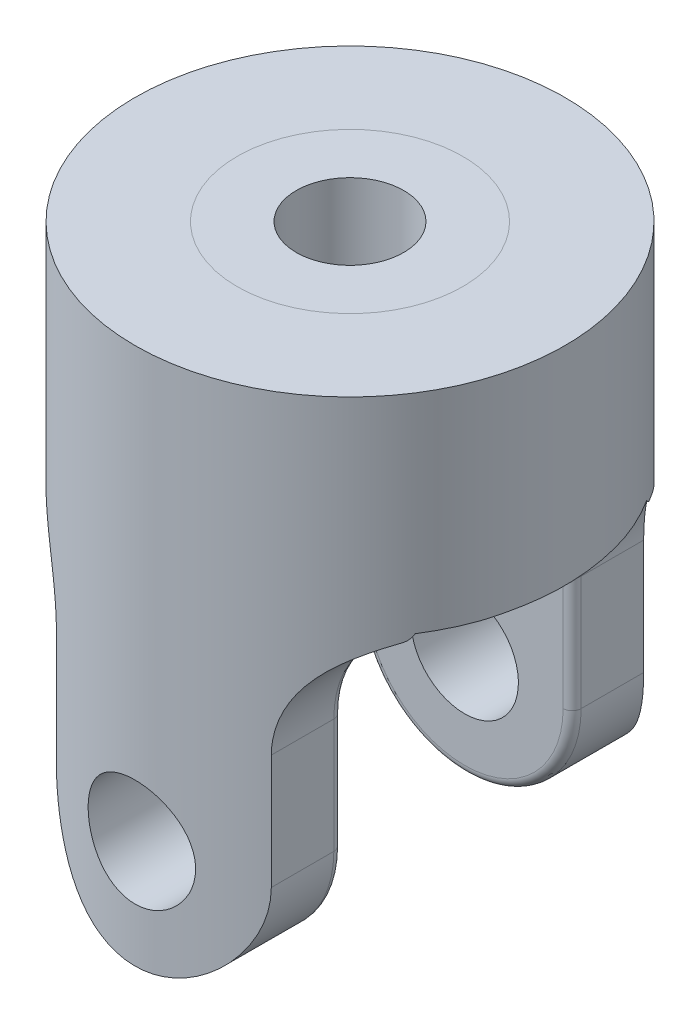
ISO-10303-21;
HEADER;
FILE_DESCRIPTION(('STEP AP214'),'2;1');
FILE_NAME('part.step','',(''),(''),'','','');
FILE_SCHEMA(('AUTOMOTIVE_DESIGN { 1 0 10303 214 1 1 1 1 }'));
ENDSEC;
DATA;
#1=APPLICATION_CONTEXT('core data for automotive mechanical design processes');
#2=APPLICATION_PROTOCOL_DEFINITION('international standard','automotive_design',2000,#1);
#3=PRODUCT_CONTEXT('',#1,'mechanical');
#4=PRODUCT('Part','Part','',(#3));
#5=PRODUCT_RELATED_PRODUCT_CATEGORY('part','',(#4));
#6=PRODUCT_DEFINITION_FORMATION('','',#4);
#7=PRODUCT_DEFINITION_CONTEXT('part definition',#1,'design');
#8=PRODUCT_DEFINITION('design','',#6,#7);
#9=PRODUCT_DEFINITION_SHAPE('','',#8);
#10=(LENGTH_UNIT() NAMED_UNIT(*) SI_UNIT(.MILLI.,.METRE.));
#11=(NAMED_UNIT(*) PLANE_ANGLE_UNIT() SI_UNIT($,.RADIAN.));
#12=(NAMED_UNIT(*) SI_UNIT($,.STERADIAN.) SOLID_ANGLE_UNIT());
#13=UNCERTAINTY_MEASURE_WITH_UNIT(LENGTH_MEASURE(1.E-05),#10,'distance_accuracy_value','');
#14=(GEOMETRIC_REPRESENTATION_CONTEXT(3) GLOBAL_UNCERTAINTY_ASSIGNED_CONTEXT((#13)) GLOBAL_UNIT_ASSIGNED_CONTEXT((#10,
#11,#12)) REPRESENTATION_CONTEXT('',''));
#15=CARTESIAN_POINT('',(0.,0.,0.));
#16=DIRECTION('',(0.,0.,1.));
#17=DIRECTION('',(1.,0.,0.));
#18=AXIS2_PLACEMENT_3D('',#15,#16,#17);
#19=CARTESIAN_POINT('',(0.,47.625,0.));
#20=DIRECTION('',(0.,1.,0.));
#21=DIRECTION('',(0.,0.,1.));
#22=AXIS2_PLACEMENT_3D('',#19,#20,#21);
#23=PLANE('',#22);
#24=CARTESIAN_POINT('',(0.,47.625,0.));
#25=DIRECTION('',(0.,1.,0.));
#26=DIRECTION('',(0.,0.,1.));
#27=AXIS2_PLACEMENT_3D('',#24,#25,#26);
#28=CIRCLE('',#27,19.05);
#29=CARTESIAN_POINT('',(0.,47.625,19.05));
#30=VERTEX_POINT('',#29);
#31=EDGE_CURVE('E216',#30,#30,#28,.T.);
#32=ORIENTED_EDGE('',*,*,#31,.T.);
#33=EDGE_LOOP('',(#32));
#34=FACE_BOUND('',#33,.T.);
#35=CARTESIAN_POINT('',(3.7470027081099E-13,47.625,-6.03683769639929E-13));
#36=DIRECTION('',(0.,1.,0.));
#37=DIRECTION('',(0.,0.,1.));
#38=AXIS2_PLACEMENT_3D('',#35,#36,#37);
#39=CIRCLE('',#38,10.);
#40=CARTESIAN_POINT('',(3.7470027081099E-13,47.625,9.9999999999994));
#41=VERTEX_POINT('',#40);
#42=EDGE_CURVE('E11',#41,#41,#39,.F.);
#43=ORIENTED_EDGE('',*,*,#42,.T.);
#44=EDGE_LOOP('',(#43));
#45=FACE_BOUND('',#44,.T.);
#46=ADVANCED_FACE('F50',(#34,#45),#23,.T.);
#47=CARTESIAN_POINT('',(0.,47.625,0.));
#48=DIRECTION('',(0.,-1.,0.));
#49=DIRECTION('',(0.,0.,-1.));
#50=AXIS2_PLACEMENT_3D('',#47,#48,#49);
#51=CYLINDRICAL_SURFACE('',#50,19.05);
#52=CARTESIAN_POINT('',(0.,14.2875,-19.05));
#53=CARTESIAN_POINT('',(-0.263131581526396,14.2874926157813,-19.0499955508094));
#54=CARTESIAN_POINT('',(-0.526345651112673,14.2656193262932,-19.0444938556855));
#55=CARTESIAN_POINT('',(-1.04523007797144,14.1788351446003,-19.0230796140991));
#56=CARTESIAN_POINT('',(-1.3008960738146,14.1138998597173,-19.0071611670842));
#57=CARTESIAN_POINT('',(-1.79711626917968,13.9432053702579,-18.966676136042));
#58=CARTESIAN_POINT('',(-2.03768821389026,13.837495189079,-18.9421199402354));
#59=CARTESIAN_POINT('',(-2.49768401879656,13.5884240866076,-18.886974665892));
#60=CARTESIAN_POINT('',(-2.71710716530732,13.4450618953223,-18.8563853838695));
#61=CARTESIAN_POINT('',(-3.13309611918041,13.121637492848,-18.7917903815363));
#62=CARTESIAN_POINT('',(-3.32916431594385,12.940945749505,-18.757731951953));
#63=CARTESIAN_POINT('',(-3.68855284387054,12.5493392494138,-18.6903874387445));
#64=CARTESIAN_POINT('',(-3.85186947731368,12.3384210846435,-18.6571014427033));
#65=CARTESIAN_POINT('',(-4.14345927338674,11.8884851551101,-18.5945391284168));
#66=CARTESIAN_POINT('',(-4.27117578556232,11.6490964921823,-18.5653297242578));
#67=CARTESIAN_POINT('',(-4.48436018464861,11.1513987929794,-18.514996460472));
#68=CARTESIAN_POINT('',(-4.56983482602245,10.8930927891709,-18.4938713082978));
#69=CARTESIAN_POINT('',(-4.69441160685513,10.3703643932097,-18.4626401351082));
#70=CARTESIAN_POINT('',(-4.73440845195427,10.1061682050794,-18.4523218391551));
#71=CARTESIAN_POINT('',(-4.76968113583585,9.57462979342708,-18.443237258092));
#72=CARTESIAN_POINT('',(-4.7649642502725,9.30728808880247,-18.4444690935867));
#73=CARTESIAN_POINT('',(-4.71165721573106,8.78390481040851,-18.4581547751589));
#74=CARTESIAN_POINT('',(-4.66413323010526,8.52774640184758,-18.4703359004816));
#75=CARTESIAN_POINT('',(-4.528261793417,8.02715866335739,-18.5041130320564));
#76=CARTESIAN_POINT('',(-4.43991143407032,7.78273017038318,-18.5257097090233));
#77=CARTESIAN_POINT('',(-4.22398659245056,7.30968179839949,-18.5761348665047));
#78=CARTESIAN_POINT('',(-4.09602516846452,7.08124640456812,-18.6050341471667));
#79=CARTESIAN_POINT('',(-3.80478117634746,6.6487080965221,-18.6667683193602));
#80=CARTESIAN_POINT('',(-3.64149242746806,6.44460944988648,-18.6996038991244));
#81=CARTESIAN_POINT('',(-3.27870637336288,6.06042852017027,-18.7666592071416));
#82=CARTESIAN_POINT('',(-3.07830936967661,5.88119699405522,-18.8008917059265));
#83=CARTESIAN_POINT('',(-2.64989283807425,5.55872255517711,-18.8660394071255));
#84=CARTESIAN_POINT('',(-2.42187246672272,5.41548074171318,-18.8969545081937));
#85=CARTESIAN_POINT('',(-1.94346794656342,5.16873938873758,-18.9521379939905));
#86=CARTESIAN_POINT('',(-1.69300967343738,5.06537804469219,-18.9763831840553));
#87=CARTESIAN_POINT('',(-1.17753132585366,4.90246255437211,-19.0153263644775));
#88=CARTESIAN_POINT('',(-0.912514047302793,4.84290002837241,-19.0300261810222));
#89=CARTESIAN_POINT('',(-0.38271440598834,4.77057222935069,-19.0479521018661));
#90=CARTESIAN_POINT('',(-0.118099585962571,4.75664839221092,-19.0514621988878));
#91=CARTESIAN_POINT('',(0.409679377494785,4.77281558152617,-19.0474220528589));
#92=CARTESIAN_POINT('',(0.672843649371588,4.80290264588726,-19.0398728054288));
#93=CARTESIAN_POINT('',(1.18622530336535,4.90528263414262,-19.0147442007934));
#94=CARTESIAN_POINT('',(1.43657675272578,4.97694351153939,-18.9973151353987));
#95=CARTESIAN_POINT('',(1.92169190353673,5.15971499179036,-18.9543914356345));
#96=CARTESIAN_POINT('',(2.15645402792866,5.27082957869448,-18.928895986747));
#97=CARTESIAN_POINT('',(2.60833595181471,5.5315997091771,-18.8719875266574));
#98=CARTESIAN_POINT('',(2.82506877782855,5.6819041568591,-18.8404775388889));
#99=CARTESIAN_POINT('',(3.23064699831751,6.015957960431,-18.7751881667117));
#100=CARTESIAN_POINT('',(3.41948756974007,6.19971308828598,-18.7414083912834));
#101=CARTESIAN_POINT('',(3.76869505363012,6.60083122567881,-18.6743643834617));
#102=CARTESIAN_POINT('',(3.92824927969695,6.81890845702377,-18.6411331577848));
#103=CARTESIAN_POINT('',(4.20849665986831,7.27942611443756,-18.5798738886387));
#104=CARTESIAN_POINT('',(4.32919153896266,7.5218654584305,-18.5518456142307));
#105=CARTESIAN_POINT('',(4.5273957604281,8.02292566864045,-18.5044745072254));
#106=CARTESIAN_POINT('',(4.60516095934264,8.28144021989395,-18.4850803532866));
#107=CARTESIAN_POINT('',(4.71597247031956,8.80843310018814,-18.457124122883));
#108=CARTESIAN_POINT('',(4.7490285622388,9.0769092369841,-18.4485596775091));
#109=CARTESIAN_POINT('',(4.76897252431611,9.60793425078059,-18.4434131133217));
#110=CARTESIAN_POINT('',(4.75715932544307,9.87043185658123,-18.4464938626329));
#111=CARTESIAN_POINT('',(4.69067285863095,10.3895648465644,-18.4635111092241));
#112=CARTESIAN_POINT('',(4.63600045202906,10.6462003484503,-18.4774473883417));
#113=CARTESIAN_POINT('',(4.48605693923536,11.1449118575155,-18.5144175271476));
#114=CARTESIAN_POINT('',(4.39102945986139,11.3870654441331,-18.5373967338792));
#115=CARTESIAN_POINT('',(4.1632661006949,11.8521650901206,-18.5898712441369));
#116=CARTESIAN_POINT('',(4.03052499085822,12.0751084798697,-18.6193674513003));
#117=CARTESIAN_POINT('',(3.72703010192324,12.5017359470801,-18.6825138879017));
#118=CARTESIAN_POINT('',(3.5553750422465,12.7047659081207,-18.7162524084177));
#119=CARTESIAN_POINT('',(3.18068125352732,13.0795618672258,-18.7835548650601));
#120=CARTESIAN_POINT('',(2.97763508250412,13.2513204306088,-18.8171187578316));
#121=CARTESIAN_POINT('',(2.54148458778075,13.5617309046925,-18.8810155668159));
#122=CARTESIAN_POINT('',(2.30790249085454,13.6997268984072,-18.911278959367));
#123=CARTESIAN_POINT('',(1.82011973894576,13.9342731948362,-18.9644313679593));
#124=CARTESIAN_POINT('',(1.56593401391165,14.0308531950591,-18.9873256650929));
#125=CARTESIAN_POINT('',(1.09350255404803,14.1654905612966,-19.0197758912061));
#126=CARTESIAN_POINT('',(0.877507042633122,14.2111451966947,-19.031032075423));
#127=CARTESIAN_POINT('',(0.441026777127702,14.2721518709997,-19.0461457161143));
#128=CARTESIAN_POINT('',(0.220542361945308,14.2875061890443,-19.0500037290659));
#129=CARTESIAN_POINT('',(0.,14.2875,-19.05));
#130=B_SPLINE_CURVE_WITH_KNOTS('',3,(#52,#53,#54,#55,#56,#57,#58,#59,#60,#61,#62,#63,#64,#65,
#66,#67,#68,#69,#70,#71,#72,#73,#74,#75,#76,#77,#78,#79,#80,#81,#82,#83,#84,#85,#86,#87,#88,#89,
#90,#91,#92,#93,#94,#95,#96,#97,#98,#99,#100,#101,#102,#103,#104,#105,#106,#107,#108,#109,#110,
#111,#112,#113,#114,#115,#116,#117,#118,#119,#120,#121,#122,#123,#124,#125,#126,#127,#128,#129),
.UNSPECIFIED.,.T.,.F.,(4,2,2,2,2,2,2,2,2,2,2,2,2,2,2,2,2,2,2,2,2,2,2,2,2,2,2,2,2,2,2,2,2,2,2,2,
2,2,4),(0.,0.788586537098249,1.57762015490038,2.36570806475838,3.15382256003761,
3.95650832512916,4.75928466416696,5.57398705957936,6.38855914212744,7.18681236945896,
7.98493571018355,8.76371428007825,9.54254833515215,10.3292442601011,11.1160779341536,
11.9253476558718,12.7346420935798,13.5467162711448,14.3586350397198,15.1497763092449,
15.940846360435,16.7201937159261,17.4996197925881,18.2928764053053,19.08627002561,
19.8991381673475,20.7119702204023,21.51990408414,22.3276611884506,23.1122150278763,
23.8967531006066,24.6766207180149,25.4565965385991,26.2569190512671,27.0574315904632,
27.8724418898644,28.6868668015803,29.3478662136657,30.008815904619),.UNSPECIFIED.);
#131=CARTESIAN_POINT('',(0.,14.2875,-19.05));
#132=VERTEX_POINT('',#131);
#133=EDGE_CURVE('E287',#132,#132,#130,.T.);
#134=ORIENTED_EDGE('',*,*,#133,.T.);
#135=EDGE_LOOP('',(#134));
#136=FACE_BOUND('',#135,.T.);
#137=CARTESIAN_POINT('',(4.7625,9.525,18.4450831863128));
#138=CARTESIAN_POINT('',(4.7624925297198,9.26201331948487,18.4450882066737));
#139=CARTESIAN_POINT('',(4.74064249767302,8.99894396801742,18.4507690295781));
#140=CARTESIAN_POINT('',(4.65395905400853,8.48035976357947,18.4728204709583));
#141=CARTESIAN_POINT('',(4.58910062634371,8.22484939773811,18.4891973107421));
#142=CARTESIAN_POINT('',(4.41863073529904,7.72895925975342,18.5306727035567));
#143=CARTESIAN_POINT('',(4.31307188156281,7.48856041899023,18.5557599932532));
#144=CARTESIAN_POINT('',(4.06435777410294,7.02885782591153,18.6118155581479));
#145=CARTESIAN_POINT('',(3.92120092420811,6.80955496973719,18.6427840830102));
#146=CARTESIAN_POINT('',(3.59798955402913,6.39344356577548,18.7078756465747));
#147=CARTESIAN_POINT('',(3.41725927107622,6.19716769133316,18.7420490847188));
#148=CARTESIAN_POINT('',(3.02548683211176,5.83737454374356,18.8092627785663));
#149=CARTESIAN_POINT('',(2.81444184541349,5.67386033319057,18.8423029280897));
#150=CARTESIAN_POINT('',(2.36438160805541,5.38205273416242,18.9040849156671));
#151=CARTESIAN_POINT('',(2.12501716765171,5.25428263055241,18.9327603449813));
#152=CARTESIAN_POINT('',(1.62737136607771,5.04099262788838,18.98200696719));
#153=CARTESIAN_POINT('',(1.36909280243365,4.95546649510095,19.0025793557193));
#154=CARTESIAN_POINT('',(0.846503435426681,4.8307983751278,19.0329456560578));
#155=CARTESIAN_POINT('',(0.582420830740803,4.79075182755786,19.0429494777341));
#156=CARTESIAN_POINT('',(0.0511089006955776,4.75534028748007,19.0517829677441));
#157=CARTESIAN_POINT('',(-0.216119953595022,4.75996868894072,19.0506142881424));
#158=CARTESIAN_POINT('',(-0.739865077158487,4.81312508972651,19.0373907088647));
#159=CARTESIAN_POINT('',(-0.99648747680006,4.86067669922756,19.0255779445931));
#160=CARTESIAN_POINT('',(-1.4979884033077,4.99676026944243,18.992675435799));
#161=CARTESIAN_POINT('',(-1.74286630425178,5.08529441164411,18.9715851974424));
#162=CARTESIAN_POINT('',(-2.21649942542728,5.30161989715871,18.9221270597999));
#163=CARTESIAN_POINT('',(-2.44508897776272,5.42975872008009,18.8936951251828));
#164=CARTESIAN_POINT('',(-2.87786265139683,5.72139256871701,18.8326376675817));
#165=CARTESIAN_POINT('',(-3.08204251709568,5.88489374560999,18.8000114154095));
#166=CARTESIAN_POINT('',(-3.46602384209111,6.24784515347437,18.733078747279));
#167=CARTESIAN_POINT('',(-3.6450159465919,6.44814856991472,18.6987507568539));
#168=CARTESIAN_POINT('',(-3.96704999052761,6.87628794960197,18.6330915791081));
#169=CARTESIAN_POINT('',(-4.11009024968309,7.10412519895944,18.6017605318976));
#170=CARTESIAN_POINT('',(-4.35667846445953,7.58245251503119,18.5455654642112));
#171=CARTESIAN_POINT('',(-4.46003156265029,7.83304706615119,18.5207335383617));
#172=CARTESIAN_POINT('',(-4.62289026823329,8.34882531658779,18.4807600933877));
#173=CARTESIAN_POINT('',(-4.68240525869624,8.61400588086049,18.4656165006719));
#174=CARTESIAN_POINT('',(-4.75455546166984,9.14392285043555,18.4471695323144));
#175=CARTESIAN_POINT('',(-4.76838735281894,9.40848599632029,18.4435639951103));
#176=CARTESIAN_POINT('',(-4.75205486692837,9.93614078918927,18.4477788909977));
#177=CARTESIAN_POINT('',(-4.72189453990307,10.1992325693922,18.4555982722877));
#178=CARTESIAN_POINT('',(-4.61948300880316,10.7120326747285,18.4814924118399));
#179=CARTESIAN_POINT('',(-4.54792855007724,10.9618895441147,18.4993972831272));
#180=CARTESIAN_POINT('',(-4.36553244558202,11.4460619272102,18.5432836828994));
#181=CARTESIAN_POINT('',(-4.25468614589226,11.6803755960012,18.5692661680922));
#182=CARTESIAN_POINT('',(-3.99434812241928,12.1318806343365,18.6270164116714));
#183=CARTESIAN_POINT('',(-3.84414094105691,12.3486459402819,18.6588876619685));
#184=CARTESIAN_POINT('',(-3.51024964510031,12.7543338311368,18.7245704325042));
#185=CARTESIAN_POINT('',(-3.3265600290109,12.9432518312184,18.7583822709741));
#186=CARTESIAN_POINT('',(-2.92542620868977,13.2927300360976,18.8251605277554));
#187=CARTESIAN_POINT('',(-2.70725242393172,13.4524624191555,18.8580846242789));
#188=CARTESIAN_POINT('',(-2.24648402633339,13.7330228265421,18.9185019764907));
#189=CARTESIAN_POINT('',(-2.00389068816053,13.8538528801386,18.9459955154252));
#190=CARTESIAN_POINT('',(-1.50284593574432,14.0521296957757,18.9922807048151));
#191=CARTESIAN_POINT('',(-1.24452402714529,14.1298884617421,19.0111347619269));
#192=CARTESIAN_POINT('',(-0.717945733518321,14.240751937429,19.0382898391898));
#193=CARTESIAN_POINT('',(-0.449691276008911,14.2738652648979,19.0465928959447));
#194=CARTESIAN_POINT('',(0.0813602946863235,14.2940131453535,19.0516273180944));
#195=CARTESIAN_POINT('',(0.344108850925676,14.2822693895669,19.0486654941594));
#196=CARTESIAN_POINT('',(0.863762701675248,14.2158347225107,19.0321833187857));
#197=CARTESIAN_POINT('',(1.12066816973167,14.1611450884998,19.0186632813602));
#198=CARTESIAN_POINT('',(1.62006455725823,14.0110263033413,18.9826312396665));
#199=CARTESIAN_POINT('',(1.86262563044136,13.9158180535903,18.9601680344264));
#200=CARTESIAN_POINT('',(2.32846746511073,13.6875651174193,18.908615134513));
#201=CARTESIAN_POINT('',(2.55174579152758,13.5545156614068,18.8795246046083));
#202=CARTESIAN_POINT('',(2.97847668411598,13.2506311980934,18.8169827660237));
#203=CARTESIAN_POINT('',(3.18132613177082,13.0789673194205,18.7834436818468));
#204=CARTESIAN_POINT('',(3.55575403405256,12.7043361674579,18.7161796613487));
#205=CARTESIAN_POINT('',(3.72732454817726,12.5013609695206,18.6824546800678));
#206=CARTESIAN_POINT('',(4.0374666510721,12.0653107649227,18.6179210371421));
#207=CARTESIAN_POINT('',(4.1753628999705,11.831744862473,18.5871785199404));
#208=CARTESIAN_POINT('',(4.4097268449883,11.3440107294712,18.5329808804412));
#209=CARTESIAN_POINT('',(4.50622468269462,11.0898576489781,18.5095204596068));
#210=CARTESIAN_POINT('',(4.6406872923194,10.6176269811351,18.4762096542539));
#211=CARTESIAN_POINT('',(4.68626747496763,10.401808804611,18.4646250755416));
#212=CARTESIAN_POINT('',(4.74717566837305,9.96567951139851,18.4490600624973));
#213=CARTESIAN_POINT('',(4.76250625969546,9.74536877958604,18.4450789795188));
#214=CARTESIAN_POINT('',(4.7625,9.525,18.4450831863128));
#215=B_SPLINE_CURVE_WITH_KNOTS('',3,(#137,#138,#139,#140,#141,#142,#143,#144,#145,#146,#147,
#148,#149,#150,#151,#152,#153,#154,#155,#156,#157,#158,#159,#160,#161,#162,#163,#164,#165,#166,
#167,#168,#169,#170,#171,#172,#173,#174,#175,#176,#177,#178,#179,#180,#181,#182,#183,#184,#185,
#186,#187,#188,#189,#190,#191,#192,#193,#194,#195,#196,#197,#198,#199,#200,#201,#202,#203,#204,
#205,#206,#207,#208,#209,#210,#211,#212,#213,#214),.UNSPECIFIED.,.T.,.F.,(4,2,2,2,2,2,2,2,2,2,2,
2,2,2,2,2,2,2,2,2,2,2,2,2,2,2,2,2,2,2,2,2,2,2,2,2,2,2,4),(0.,0.788150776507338,1.57676038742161,
2.36435403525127,3.15198112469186,3.95523632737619,4.75856658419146,5.57310600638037,
6.3875251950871,7.18544570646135,7.98324823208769,8.76334790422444,9.54348910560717,
10.3306792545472,11.1180064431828,11.9266423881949,12.7353161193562,13.5479110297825,
14.3603319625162,15.1512950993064,15.9421854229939,16.7201355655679,17.4981778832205,
18.2914832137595,19.0849190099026,19.8982075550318,20.7114536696,21.5187289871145,
22.3258484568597,23.1111446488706,23.896417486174,24.677462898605,25.4586067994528,
26.258464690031,27.0585253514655,27.8735118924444,28.6879040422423,29.3483886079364,
30.0088168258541),.UNSPECIFIED.);
#216=CARTESIAN_POINT('',(4.7625,9.525,18.4450831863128));
#217=VERTEX_POINT('',#216);
#218=EDGE_CURVE('E299',#217,#217,#215,.T.);
#219=ORIENTED_EDGE('',*,*,#218,.T.);
#220=EDGE_LOOP('',(#219));
#221=FACE_BOUND('',#220,.T.);
#222=ORIENTED_EDGE('',*,*,#31,.F.);
#223=EDGE_LOOP('',(#222));
#224=FACE_BOUND('',#223,.T.);
#225=CARTESIAN_POINT('',(0.,29.1452388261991,0.));
#226=DIRECTION('',(0.,1.,0.));
#227=DIRECTION('',(0.,0.,1.));
#228=AXIS2_PLACEMENT_3D('',#225,#226,#227);
#229=CIRCLE('',#228,19.05);
#230=CARTESIAN_POINT('',(-17.9411689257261,29.1452388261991,6.40444826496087));
#231=VERTEX_POINT('',#230);
#232=CARTESIAN_POINT('',(-16.0465941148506,29.1452388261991,10.2669039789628));
#233=VERTEX_POINT('',#232);
#234=EDGE_CURVE('E199',#231,#233,#229,.T.);
#235=ORIENTED_EDGE('',*,*,#234,.T.);
#236=CARTESIAN_POINT('',(-16.0465941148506,29.1452388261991,10.2669039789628));
#237=CARTESIAN_POINT('',(-16.03727687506,29.1157831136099,10.2814663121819));
#238=CARTESIAN_POINT('',(-16.0271745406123,29.0872011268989,10.2972119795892));
#239=CARTESIAN_POINT('',(-16.0055557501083,29.0318945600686,10.3307833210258));
#240=CARTESIAN_POINT('',(-15.9940408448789,29.0051679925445,10.3486067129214));
#241=CARTESIAN_POINT('',(-15.9576708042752,28.9280401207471,10.4046726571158));
#242=CARTESIAN_POINT('',(-15.9309167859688,28.8804640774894,10.4456265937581));
#243=CARTESIAN_POINT('',(-15.8742304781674,28.7948098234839,10.5315660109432));
#244=CARTESIAN_POINT('',(-15.8444182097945,28.7564886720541,10.5763928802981));
#245=CARTESIAN_POINT('',(-15.7816164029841,28.6878878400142,10.6698758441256));
#246=CARTESIAN_POINT('',(-15.7486256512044,28.6576112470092,10.7185333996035));
#247=CARTESIAN_POINT('',(-15.6930675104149,28.6155571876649,10.7996090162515));
#248=CARTESIAN_POINT('',(-15.67127965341,28.6011148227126,10.8312051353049));
#249=CARTESIAN_POINT('',(-15.6268999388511,28.575819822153,10.8951372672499));
#250=CARTESIAN_POINT('',(-15.6043100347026,28.5649590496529,10.9274714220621));
#251=CARTESIAN_POINT('',(-15.5813577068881,28.5559720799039,10.9601));
#252=B_SPLINE_CURVE_WITH_KNOTS('',3,(#236,#237,#238,#239,#240,#241,#242,#243,#244,#245,#246,
#247,#248,#249,#250,#251),.UNSPECIFIED.,.F.,.F.,(4,2,2,2,2,2,2,4),(0.,0.102363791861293,
0.204616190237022,0.408337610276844,0.605922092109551,0.803582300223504,0.926449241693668,
1.04903509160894),.UNSPECIFIED.);
#253=CARTESIAN_POINT('',(-15.5813577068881,28.5559720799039,10.9601));
#254=VERTEX_POINT('',#253);
#255=EDGE_CURVE('E382',#233,#254,#252,.T.);
#256=ORIENTED_EDGE('',*,*,#255,.T.);
#257=CARTESIAN_POINT('',(-9.525,19.685,-16.4977839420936));
#258=CARTESIAN_POINT('',(-9.52496088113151,19.918350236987,-16.4977688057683));
#259=CARTESIAN_POINT('',(-9.53357353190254,20.1516967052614,-16.4928328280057));
#260=CARTESIAN_POINT('',(-9.56782146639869,20.6166980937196,-16.4730087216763));
#261=CARTESIAN_POINT('',(-9.59345572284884,20.8483531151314,-16.4581211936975));
#262=CARTESIAN_POINT('',(-9.66141942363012,21.3080009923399,-16.4183108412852));
#263=CARTESIAN_POINT('',(-9.70372594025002,21.5359984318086,-16.3934017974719));
#264=CARTESIAN_POINT('',(-9.80447669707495,21.9870210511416,-16.3333461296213));
#265=CARTESIAN_POINT('',(-9.86292069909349,22.2100463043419,-16.2981996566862));
#266=CARTESIAN_POINT('',(-9.99521577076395,22.6496636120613,-16.217402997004));
#267=CARTESIAN_POINT('',(-10.0690752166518,22.8662520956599,-16.1717470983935));
#268=CARTESIAN_POINT('',(-10.2311827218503,23.2913603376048,-16.0696785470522));
#269=CARTESIAN_POINT('',(-10.3194309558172,23.4998799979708,-16.0132657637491));
#270=CARTESIAN_POINT('',(-10.5090589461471,23.9073731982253,-15.8894615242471));
#271=CARTESIAN_POINT('',(-10.6104339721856,24.1063501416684,-15.8220740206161));
#272=CARTESIAN_POINT('',(-10.8249101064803,24.4935871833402,-15.676116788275));
#273=CARTESIAN_POINT('',(-10.9380111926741,24.6818473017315,-15.597547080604));
#274=CARTESIAN_POINT('',(-11.1750060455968,25.0476354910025,-15.4286429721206));
#275=CARTESIAN_POINT('',(-11.2989577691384,25.2250961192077,-15.3382439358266));
#276=CARTESIAN_POINT('',(-11.5553164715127,25.5672655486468,-15.1460495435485));
#277=CARTESIAN_POINT('',(-11.6877234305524,25.7319743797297,-15.0442542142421));
#278=CARTESIAN_POINT('',(-11.9591574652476,26.0480960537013,-14.8293967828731));
#279=CARTESIAN_POINT('',(-12.0981857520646,26.1995064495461,-14.7163326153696));
#280=CARTESIAN_POINT('',(-12.3809708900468,26.4887188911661,-14.4792302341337));
#281=CARTESIAN_POINT('',(-12.5247282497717,26.6265194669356,-14.3551908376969));
#282=CARTESIAN_POINT('',(-12.8240785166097,26.8965620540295,-14.0885806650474));
#283=CARTESIAN_POINT('',(-12.9798547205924,27.0279377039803,-13.9453388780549));
#284=CARTESIAN_POINT('',(-13.292575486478,27.2756182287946,-13.6475843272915));
#285=CARTESIAN_POINT('',(-13.4495200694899,27.3919228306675,-13.4930713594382));
#286=CARTESIAN_POINT('',(-13.7627279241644,27.6100750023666,-13.1734537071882));
#287=CARTESIAN_POINT('',(-13.91899104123,27.7119194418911,-13.0083467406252));
#288=CARTESIAN_POINT('',(-14.2291584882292,27.9019462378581,-12.6683290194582));
#289=CARTESIAN_POINT('',(-14.3830623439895,27.9901258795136,-12.4934163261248));
#290=CARTESIAN_POINT('',(-14.7634251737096,28.1948863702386,-12.0444336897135));
#291=CARTESIAN_POINT('',(-14.9875078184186,28.3034922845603,-11.7646791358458));
#292=CARTESIAN_POINT('',(-15.4232003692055,28.4957157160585,-11.1874194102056));
#293=CARTESIAN_POINT('',(-15.6348051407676,28.5793230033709,-10.8899070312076));
#294=CARTESIAN_POINT('',(-16.0431146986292,28.7255421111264,-10.2789237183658));
#295=CARTESIAN_POINT('',(-16.2397846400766,28.7881059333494,-9.96541815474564));
#296=CARTESIAN_POINT('',(-16.615638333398,28.8957388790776,-9.3252837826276));
#297=CARTESIAN_POINT('',(-16.7948218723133,28.9408077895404,-8.99865481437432));
#298=CARTESIAN_POINT('',(-17.1918461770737,29.029905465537,-8.22145899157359));
#299=CARTESIAN_POINT('',(-17.4021973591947,29.0684013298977,-7.76641658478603));
#300=CARTESIAN_POINT('',(-17.786699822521,29.1278564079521,-6.84014068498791));
#301=CARTESIAN_POINT('',(-17.9608394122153,29.1488099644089,-6.36890201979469));
#302=CARTESIAN_POINT('',(-18.2714417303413,29.1794105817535,-5.41378881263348));
#303=CARTESIAN_POINT('',(-18.4079009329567,29.1890565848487,-4.92991309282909));
#304=CARTESIAN_POINT('',(-18.6421466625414,29.2019870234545,-3.95287775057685));
#305=CARTESIAN_POINT('',(-18.7399368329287,29.2052720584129,-3.45971900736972));
#306=CARTESIAN_POINT('',(-18.897358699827,29.2091078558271,-2.46008138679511));
#307=CARTESIAN_POINT('',(-18.9564226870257,29.2096187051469,-1.95351291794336));
#308=CARTESIAN_POINT('',(-19.033752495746,29.2100647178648,-0.937263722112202));
#309=CARTESIAN_POINT('',(-19.0520174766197,29.209999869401,-0.427582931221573));
#310=CARTESIAN_POINT('',(-19.0476285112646,29.2100001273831,0.591825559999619));
#311=CARTESIAN_POINT('',(-19.0249568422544,29.2100652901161,1.10155318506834));
#312=CARTESIAN_POINT('',(-18.9388075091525,29.2094475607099,2.11754548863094));
#313=CARTESIAN_POINT('',(-18.8753295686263,29.2087646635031,2.62381014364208));
#314=CARTESIAN_POINT('',(-18.7036160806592,29.2041086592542,3.65580332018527));
#315=CARTESIAN_POINT('',(-18.5932233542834,29.1999661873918,4.18117378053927));
#316=CARTESIAN_POINT('',(-18.3285057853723,29.1835599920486,5.22073652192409));
#317=CARTESIAN_POINT('',(-18.1741722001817,29.1712946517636,5.73492655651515));
#318=CARTESIAN_POINT('',(-17.8230306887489,29.1322930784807,6.74751648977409));
#319=CARTESIAN_POINT('',(-17.6262637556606,29.1055707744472,7.24593109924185));
#320=CARTESIAN_POINT('',(-17.1921907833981,29.0296619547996,8.22291578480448));
#321=CARTESIAN_POINT('',(-16.9549063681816,28.9804873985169,8.70149627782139));
#322=CARTESIAN_POINT('',(-16.5317482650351,28.8726944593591,9.47232063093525));
#323=CARTESIAN_POINT('',(-16.356505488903,28.8232353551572,9.77172744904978));
#324=CARTESIAN_POINT('',(-15.9915321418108,28.7076409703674,10.3582119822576));
#325=CARTESIAN_POINT('',(-15.8018055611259,28.6415102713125,10.6452930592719));
#326=CARTESIAN_POINT('',(-15.4100602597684,28.4895738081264,11.2048655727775));
#327=CARTESIAN_POINT('',(-15.2080616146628,28.4037995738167,11.4773795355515));
#328=CARTESIAN_POINT('',(-14.794100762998,28.2093882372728,12.0062371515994));
#329=CARTESIAN_POINT('',(-14.5821407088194,28.1007560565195,12.2625842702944));
#330=CARTESIAN_POINT('',(-14.1961331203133,27.8828084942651,12.7059055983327));
#331=CARTESIAN_POINT('',(-14.0232896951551,27.7782615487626,12.8962780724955));
#332=CARTESIAN_POINT('',(-13.6756323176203,27.5516907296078,13.2643740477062));
#333=CARTESIAN_POINT('',(-13.5008188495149,27.4296710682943,13.4421005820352));
#334=CARTESIAN_POINT('',(-13.1516762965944,27.1671845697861,13.7838888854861));
#335=CARTESIAN_POINT('',(-12.9773471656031,27.0267195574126,13.947952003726));
#336=CARTESIAN_POINT('',(-12.6319391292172,26.726763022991,14.2615225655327));
#337=CARTESIAN_POINT('',(-12.4608602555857,26.5672713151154,14.4110298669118));
#338=CARTESIAN_POINT('',(-12.1237135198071,26.2279198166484,14.6958204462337));
#339=CARTESIAN_POINT('',(-11.9576926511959,26.0479167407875,14.8309890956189));
#340=CARTESIAN_POINT('',(-11.6351953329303,25.6689938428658,15.0853214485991));
#341=CARTESIAN_POINT('',(-11.4787191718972,25.4700734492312,15.2044846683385));
#342=CARTESIAN_POINT('',(-11.1784747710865,25.0543983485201,15.4265708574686));
#343=CARTESIAN_POINT('',(-11.0347050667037,24.8376457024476,15.5294956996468));
#344=CARTESIAN_POINT('',(-10.7628059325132,24.3878782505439,15.7191604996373));
#345=CARTESIAN_POINT('',(-10.6346741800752,24.154865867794,15.8059028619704));
#346=CARTESIAN_POINT('',(-10.4115375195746,23.7046522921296,15.9536199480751));
#347=CARTESIAN_POINT('',(-10.3143937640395,23.4891174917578,16.0164604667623));
#348=CARTESIAN_POINT('',(-10.1355425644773,23.04871010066,16.1302361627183));
#349=CARTESIAN_POINT('',(-10.0538339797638,22.8238382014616,16.181172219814));
#350=CARTESIAN_POINT('',(-9.90713729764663,22.3666546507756,16.2714028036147));
#351=CARTESIAN_POINT('',(-9.84213485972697,22.1343495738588,16.3107073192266));
#352=CARTESIAN_POINT('',(-9.72972257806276,21.6640173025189,16.3780123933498));
#353=CARTESIAN_POINT('',(-9.6823065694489,21.4259921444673,16.4060169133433));
#354=CARTESIAN_POINT('',(-9.60449707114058,20.9383691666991,16.4516946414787));
#355=CARTESIAN_POINT('',(-9.57468865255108,20.6886433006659,16.4690135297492));
#356=CARTESIAN_POINT('',(-9.54488066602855,20.3127872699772,16.48629321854));
#357=CARTESIAN_POINT('',(-9.5374287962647,20.1873921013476,16.4906033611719));
#358=CARTESIAN_POINT('',(-9.52748802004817,19.9363374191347,16.4963477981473));
#359=CARTESIAN_POINT('',(-9.52499919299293,19.8106779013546,16.4977820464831));
#360=CARTESIAN_POINT('',(-9.525,19.685,16.4977839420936));
#361=B_SPLINE_CURVE_WITH_KNOTS('',3,(#257,#258,#259,#260,#261,#262,#263,#264,#265,#266,#267,
#268,#269,#270,#271,#272,#273,#274,#275,#276,#277,#278,#279,#280,#281,#282,#283,#284,#285,#286,
#287,#288,#289,#290,#291,#292,#293,#294,#295,#296,#297,#298,#299,#300,#301,#302,#303,#304,#305,
#306,#307,#308,#309,#310,#311,#312,#313,#314,#315,#316,#317,#318,#319,#320,#321,#322,#323,#324,
#325,#326,#327,#328,#329,#330,#331,#332,#333,#334,#335,#336,#337,#338,#339,#340,#341,#342,#343,
#344,#345,#346,#347,#348,#349,#350,#351,#352,#353,#354,#355,#356,#357,#358,#359,#360),
.UNSPECIFIED.,.F.,.F.,(4,2,2,2,2,2,2,2,2,2,2,2,2,2,2,2,2,2,2,2,2,2,2,2,2,2,2,2,2,2,2,2,2,2,2,2,
2,2,2,2,2,2,2,2,2,2,2,2,2,2,2,4),(0.,0.699834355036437,1.39962647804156,2.09845958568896,
2.79728237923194,3.49648588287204,4.19569787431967,4.8946585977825,5.59361800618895,
6.29656980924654,6.99951996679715,7.70259920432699,8.40575429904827,9.15225685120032,
9.89877292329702,10.6454503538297,11.3922759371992,12.514141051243,13.6364646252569,
14.7613310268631,15.8862111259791,17.392458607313,18.899191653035,20.40606563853,
21.9127976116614,23.4411511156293,24.9695361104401,26.4985829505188,28.0276401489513,
29.6362655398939,31.2452112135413,32.852609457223,34.4591525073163,35.50965675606,
36.5598726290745,37.6084144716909,38.6567307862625,39.4886840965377,40.3204371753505,
41.1521080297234,41.9837870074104,42.8216802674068,43.6595988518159,44.4974207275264,
45.3351180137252,46.0680642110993,46.8009562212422,47.5332170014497,48.2652208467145,
49.02034913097,49.3973072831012,49.7742714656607),.UNSPECIFIED.);
#362=CARTESIAN_POINT('',(-9.525,19.685,16.4977839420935));
#363=VERTEX_POINT('',#362);
#364=EDGE_CURVE('E493',#254,#363,#361,.T.);
#365=ORIENTED_EDGE('',*,*,#364,.T.);
#366=DIRECTION('',(0.,-1.,0.));
#367=VECTOR('',#366,1.);
#368=CARTESIAN_POINT('',(-9.52499999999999,47.625,16.4977839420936));
#369=LINE('',#368,#367);
#370=CARTESIAN_POINT('',(-9.525,9.525,16.4977839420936));
#371=VERTEX_POINT('',#370);
#372=EDGE_CURVE('E496',#363,#371,#369,.T.);
#373=ORIENTED_EDGE('',*,*,#372,.T.);
#374=CARTESIAN_POINT('',(9.525,9.525,16.4977839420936));
#375=CARTESIAN_POINT('',(9.52500093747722,9.40027257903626,16.4977810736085));
#376=CARTESIAN_POINT('',(9.5225495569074,9.27556275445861,16.4991989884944));
#377=CARTESIAN_POINT('',(9.51275833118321,9.02640408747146,16.5048470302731));
#378=CARTESIAN_POINT('',(9.50541869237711,8.90195523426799,16.5090770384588));
#379=CARTESIAN_POINT('',(9.47610793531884,8.52953393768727,16.5259318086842));
#380=CARTESIAN_POINT('',(9.4468449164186,8.28227418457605,16.5427214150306));
#381=CARTESIAN_POINT('',(9.36949132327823,7.79316834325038,16.5866536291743));
#382=CARTESIAN_POINT('',(9.32150961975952,7.55129934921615,16.6137363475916));
#383=CARTESIAN_POINT('',(9.20730560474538,7.07314911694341,16.6772985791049));
#384=CARTESIAN_POINT('',(9.14108119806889,6.83686852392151,16.7137791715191));
#385=CARTESIAN_POINT('',(8.99129510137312,6.37194751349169,16.7948306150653));
#386=CARTESIAN_POINT('',(8.90777526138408,6.14329017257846,16.8393819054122));
#387=CARTESIAN_POINT('',(8.72407711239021,5.69420111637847,16.9352799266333));
#388=CARTESIAN_POINT('',(8.62389244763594,5.47377257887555,16.9866292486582));
#389=CARTESIAN_POINT('',(8.29930376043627,4.82601405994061,17.1488381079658));
#390=CARTESIAN_POINT('',(8.05095104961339,4.41247529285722,17.2678097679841));
#391=CARTESIAN_POINT('',(7.47383610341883,3.59736922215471,17.5257462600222));
#392=CARTESIAN_POINT('',(7.14015861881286,3.19954734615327,17.6655504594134));
#393=CARTESIAN_POINT('',(6.5945742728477,2.64718480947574,17.8732248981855));
#394=CARTESIAN_POINT('',(6.40509661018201,2.47038257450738,17.9421446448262));
#395=CARTESIAN_POINT('',(6.01181385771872,2.13237428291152,18.0777156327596));
#396=CARTESIAN_POINT('',(5.80800671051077,1.97117047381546,18.1443665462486));
#397=CARTESIAN_POINT('',(5.37278064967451,1.65505544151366,18.2781569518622));
#398=CARTESIAN_POINT('',(5.14042653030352,1.50131409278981,18.3450225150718));
#399=CARTESIAN_POINT('',(4.66194023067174,1.21417930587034,18.4724136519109));
#400=CARTESIAN_POINT('',(4.41581396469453,1.08077722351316,18.5329419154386));
#401=CARTESIAN_POINT('',(3.91130485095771,0.83558357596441,18.6459377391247));
#402=CARTESIAN_POINT('',(3.65292491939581,0.723786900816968,18.6984072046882));
#403=CARTESIAN_POINT('',(3.1257193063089,0.523053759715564,18.7937250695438));
#404=CARTESIAN_POINT('',(2.85689473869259,0.434114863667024,18.8365744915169));
#405=CARTESIAN_POINT('',(2.33040396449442,0.2857231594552,18.9086545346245));
#406=CARTESIAN_POINT('',(2.07330466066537,0.224622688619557,18.9386372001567));
#407=CARTESIAN_POINT('',(1.55394863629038,0.123892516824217,18.9883061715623));
#408=CARTESIAN_POINT('',(1.29169214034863,0.0842618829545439,19.0079929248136));
#409=CARTESIAN_POINT('',(0.764329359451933,0.0270138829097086,19.0364912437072));
#410=CARTESIAN_POINT('',(0.499224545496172,0.00938565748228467,19.0453081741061));
#411=CARTESIAN_POINT('',(-0.031660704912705,-0.00364684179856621,19.0518227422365));
#412=CARTESIAN_POINT('',(-0.297441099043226,0.00094752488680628,19.0495210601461));
#413=CARTESIAN_POINT('',(-0.804260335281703,0.0309220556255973,19.0345541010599));
#414=CARTESIAN_POINT('',(-1.04543822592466,0.0544573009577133,19.0228087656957));
#415=CARTESIAN_POINT('',(-1.52469707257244,0.119714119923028,18.9904047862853));
#416=CARTESIAN_POINT('',(-1.76277824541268,0.161434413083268,18.9697467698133));
#417=CARTESIAN_POINT('',(-2.23423979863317,0.262606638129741,18.9200123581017));
#418=CARTESIAN_POINT('',(-2.46762011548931,0.322058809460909,18.8909358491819));
#419=CARTESIAN_POINT('',(-2.92820911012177,0.458088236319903,18.8250425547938));
#420=CARTESIAN_POINT('',(-3.15541756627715,0.534666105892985,18.7882254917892));
#421=CARTESIAN_POINT('',(-3.605393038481,0.705394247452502,18.7071268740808));
#422=CARTESIAN_POINT('',(-3.82805781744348,0.799769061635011,18.662750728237));
#423=CARTESIAN_POINT('',(-4.26455258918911,1.00458926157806,18.5678772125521));
#424=CARTESIAN_POINT('',(-4.47837941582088,1.11504034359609,18.51737767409));
#425=CARTESIAN_POINT('',(-5.10493628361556,1.46924131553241,18.3583058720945));
#426=CARTESIAN_POINT('',(-5.50300713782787,1.73594015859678,18.2421108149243));
#427=CARTESIAN_POINT('',(-6.28824042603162,2.35173975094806,17.9874060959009));
#428=CARTESIAN_POINT('',(-6.67082158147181,2.70624414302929,17.8478253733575));
#429=CARTESIAN_POINT('',(-7.19758780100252,3.28095380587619,17.638966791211));
#430=CARTESIAN_POINT('',(-7.36544169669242,3.47985996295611,17.5693768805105));
#431=CARTESIAN_POINT('',(-7.68466910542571,3.89124176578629,17.4321111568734));
#432=CARTESIAN_POINT('',(-7.83604008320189,4.10371949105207,17.3644356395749));
#433=CARTESIAN_POINT('',(-8.13051871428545,4.5553331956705,17.2286143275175));
#434=CARTESIAN_POINT('',(-8.27246277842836,4.7953046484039,17.1607200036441));
#435=CARTESIAN_POINT('',(-8.53533313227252,5.28806294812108,17.0315012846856));
#436=CARTESIAN_POINT('',(-8.65626905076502,5.54084385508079,16.9701738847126));
#437=CARTESIAN_POINT('',(-8.87577538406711,6.05731622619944,16.856404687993));
#438=CARTESIAN_POINT('',(-8.97438588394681,6.32098711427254,16.8039470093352));
#439=CARTESIAN_POINT('',(-9.14827185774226,6.85774586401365,16.7099199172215));
#440=CARTESIAN_POINT('',(-9.22355744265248,7.13082958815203,16.6683457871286));
#441=CARTESIAN_POINT('',(-9.32597272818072,7.57995506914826,16.6111629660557));
#442=CARTESIAN_POINT('',(-9.36056268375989,7.75384156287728,16.5916705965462));
#443=CARTESIAN_POINT('',(-9.42003837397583,8.10374181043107,16.5579753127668));
#444=CARTESIAN_POINT('',(-9.44492679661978,8.27975496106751,16.5437709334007));
#445=CARTESIAN_POINT('',(-9.4848665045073,8.63355937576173,16.5209069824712));
#446=CARTESIAN_POINT('',(-9.49990078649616,8.81135317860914,16.5122569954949));
#447=CARTESIAN_POINT('',(-9.51997579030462,9.16776164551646,16.5006843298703));
#448=CARTESIAN_POINT('',(-9.52501242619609,9.34637661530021,16.4977639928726));
#449=CARTESIAN_POINT('',(-9.525,9.525,16.4977839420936));
#450=B_SPLINE_CURVE_WITH_KNOTS('',3,(#374,#375,#376,#377,#378,#379,#380,#381,#382,#383,#384,
#385,#386,#387,#388,#389,#390,#391,#392,#393,#394,#395,#396,#397,#398,#399,#400,#401,#402,#403,
#404,#405,#406,#407,#408,#409,#410,#411,#412,#413,#414,#415,#416,#417,#418,#419,#420,#421,#422,
#423,#424,#425,#426,#427,#428,#429,#430,#431,#432,#433,#434,#435,#436,#437,#438,#439,#440,#441,
#442,#443,#444,#445,#446,#447,#448,#449),.UNSPECIFIED.,.F.,.F.,(4,2,2,2,2,2,2,2,2,2,2,2,2,2,2,2,
2,2,2,2,2,2,2,2,2,2,2,2,2,2,2,2,2,2,2,2,2,4),(0.,0.374115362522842,0.748214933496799,
1.49577871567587,2.23905786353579,2.98242241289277,3.72400882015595,4.4658787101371,
5.95045512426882,7.55645263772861,8.36024673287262,9.16415647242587,10.0226343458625,
10.8807463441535,11.7386551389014,12.5964726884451,13.3932583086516,14.1900093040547,
14.9863669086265,15.7826757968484,16.5096401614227,17.2365533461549,17.9634763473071,
18.6904254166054,19.4272479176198,20.1643321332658,21.6376476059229,23.250115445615,
24.0576502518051,24.8653090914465,25.725087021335,26.5844698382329,27.4422971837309,
28.2997521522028,28.8345228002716,29.3691451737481,29.9046876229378,30.4404488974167),.UNSPECIFIED.);
#451=CARTESIAN_POINT('',(9.525,9.525,16.4977839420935));
#452=VERTEX_POINT('',#451);
#453=EDGE_CURVE('E256',#452,#371,#450,.T.);
#454=ORIENTED_EDGE('',*,*,#453,.F.);
#455=DIRECTION('',(0.,-1.,0.));
#456=VECTOR('',#455,1.);
#457=CARTESIAN_POINT('',(9.52499999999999,47.625,16.4977839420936));
#458=LINE('',#457,#456);
#459=CARTESIAN_POINT('',(9.525,19.685,16.4977839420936));
#460=VERTEX_POINT('',#459);
#461=EDGE_CURVE('E212',#460,#452,#458,.T.);
#462=ORIENTED_EDGE('',*,*,#461,.F.);
#463=CARTESIAN_POINT('',(9.525,19.685,-16.4977839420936));
#464=CARTESIAN_POINT('',(9.52496088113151,19.918350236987,-16.4977688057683));
#465=CARTESIAN_POINT('',(9.53357353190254,20.1516967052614,-16.4928328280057));
#466=CARTESIAN_POINT('',(9.56782146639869,20.6166980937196,-16.4730087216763));
#467=CARTESIAN_POINT('',(9.59345572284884,20.8483531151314,-16.4581211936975));
#468=CARTESIAN_POINT('',(9.66141942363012,21.3080009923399,-16.4183108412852));
#469=CARTESIAN_POINT('',(9.70372594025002,21.5359984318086,-16.3934017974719));
#470=CARTESIAN_POINT('',(9.80447669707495,21.9870210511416,-16.3333461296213));
#471=CARTESIAN_POINT('',(9.86292069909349,22.2100463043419,-16.2981996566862));
#472=CARTESIAN_POINT('',(9.99521577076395,22.6496636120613,-16.217402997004));
#473=CARTESIAN_POINT('',(10.0690752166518,22.8662520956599,-16.1717470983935));
#474=CARTESIAN_POINT('',(10.2311827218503,23.2913603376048,-16.0696785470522));
#475=CARTESIAN_POINT('',(10.3194309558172,23.4998799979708,-16.0132657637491));
#476=CARTESIAN_POINT('',(10.5090589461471,23.9073731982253,-15.8894615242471));
#477=CARTESIAN_POINT('',(10.6104339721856,24.1063501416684,-15.8220740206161));
#478=CARTESIAN_POINT('',(10.8249101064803,24.4935871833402,-15.676116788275));
#479=CARTESIAN_POINT('',(10.9380111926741,24.6818473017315,-15.597547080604));
#480=CARTESIAN_POINT('',(11.1750060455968,25.0476354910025,-15.4286429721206));
#481=CARTESIAN_POINT('',(11.2989577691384,25.2250961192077,-15.3382439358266));
#482=CARTESIAN_POINT('',(11.5553164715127,25.5672655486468,-15.1460495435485));
#483=CARTESIAN_POINT('',(11.6877234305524,25.7319743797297,-15.0442542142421));
#484=CARTESIAN_POINT('',(11.9591574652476,26.0480960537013,-14.8293967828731));
#485=CARTESIAN_POINT('',(12.0981857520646,26.1995064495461,-14.7163326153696));
#486=CARTESIAN_POINT('',(12.3809708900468,26.4887188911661,-14.4792302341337));
#487=CARTESIAN_POINT('',(12.5247282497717,26.6265194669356,-14.3551908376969));
#488=CARTESIAN_POINT('',(12.8240785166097,26.8965620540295,-14.0885806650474));
#489=CARTESIAN_POINT('',(12.9798547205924,27.0279377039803,-13.9453388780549));
#490=CARTESIAN_POINT('',(13.292575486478,27.2756182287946,-13.6475843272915));
#491=CARTESIAN_POINT('',(13.4495200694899,27.3919228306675,-13.4930713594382));
#492=CARTESIAN_POINT('',(13.7627279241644,27.6100750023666,-13.1734537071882));
#493=CARTESIAN_POINT('',(13.91899104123,27.7119194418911,-13.0083467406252));
#494=CARTESIAN_POINT('',(14.2291584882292,27.9019462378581,-12.6683290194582));
#495=CARTESIAN_POINT('',(14.3830623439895,27.9901258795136,-12.4934163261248));
#496=CARTESIAN_POINT('',(14.7634251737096,28.1948863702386,-12.0444336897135));
#497=CARTESIAN_POINT('',(14.9875078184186,28.3034922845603,-11.7646791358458));
#498=CARTESIAN_POINT('',(15.4232003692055,28.4957157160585,-11.1874194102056));
#499=CARTESIAN_POINT('',(15.6348051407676,28.5793230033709,-10.8899070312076));
#500=CARTESIAN_POINT('',(16.0431146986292,28.7255421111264,-10.2789237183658));
#501=CARTESIAN_POINT('',(16.2397846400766,28.7881059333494,-9.96541815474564));
#502=CARTESIAN_POINT('',(16.615638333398,28.8957388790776,-9.3252837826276));
#503=CARTESIAN_POINT('',(16.7948218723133,28.9408077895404,-8.99865481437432));
#504=CARTESIAN_POINT('',(17.1918461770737,29.029905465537,-8.22145899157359));
#505=CARTESIAN_POINT('',(17.4021973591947,29.0684013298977,-7.76641658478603));
#506=CARTESIAN_POINT('',(17.786699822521,29.1278564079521,-6.84014068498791));
#507=CARTESIAN_POINT('',(17.9608394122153,29.1488099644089,-6.36890201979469));
#508=CARTESIAN_POINT('',(18.2714417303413,29.1794105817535,-5.41378881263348));
#509=CARTESIAN_POINT('',(18.4079009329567,29.1890565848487,-4.92991309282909));
#510=CARTESIAN_POINT('',(18.6421466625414,29.2019870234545,-3.95287775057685));
#511=CARTESIAN_POINT('',(18.7399368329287,29.2052720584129,-3.45971900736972));
#512=CARTESIAN_POINT('',(18.897358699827,29.2091078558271,-2.46008138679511));
#513=CARTESIAN_POINT('',(18.9564226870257,29.2096187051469,-1.95351291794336));
#514=CARTESIAN_POINT('',(19.033752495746,29.2100647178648,-0.937263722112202));
#515=CARTESIAN_POINT('',(19.0520174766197,29.209999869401,-0.427582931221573));
#516=CARTESIAN_POINT('',(19.0476285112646,29.2100001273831,0.591825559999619));
#517=CARTESIAN_POINT('',(19.0249568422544,29.2100652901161,1.10155318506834));
#518=CARTESIAN_POINT('',(18.9388075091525,29.2094475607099,2.11754548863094));
#519=CARTESIAN_POINT('',(18.8753295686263,29.2087646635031,2.62381014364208));
#520=CARTESIAN_POINT('',(18.7036160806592,29.2041086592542,3.65580332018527));
#521=CARTESIAN_POINT('',(18.5932233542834,29.1999661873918,4.18117378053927));
#522=CARTESIAN_POINT('',(18.3285057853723,29.1835599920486,5.22073652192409));
#523=CARTESIAN_POINT('',(18.1741722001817,29.1712946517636,5.73492655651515));
#524=CARTESIAN_POINT('',(17.8230306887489,29.1322930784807,6.74751648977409));
#525=CARTESIAN_POINT('',(17.6262637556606,29.1055707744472,7.24593109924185));
#526=CARTESIAN_POINT('',(17.1921907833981,29.0296619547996,8.22291578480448));
#527=CARTESIAN_POINT('',(16.9549063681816,28.9804873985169,8.70149627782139));
#528=CARTESIAN_POINT('',(16.5317482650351,28.8726944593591,9.47232063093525));
#529=CARTESIAN_POINT('',(16.356505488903,28.8232353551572,9.77172744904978));
#530=CARTESIAN_POINT('',(15.9915321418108,28.7076409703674,10.3582119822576));
#531=CARTESIAN_POINT('',(15.8018055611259,28.6415102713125,10.6452930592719));
#532=CARTESIAN_POINT('',(15.4100602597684,28.4895738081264,11.2048655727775));
#533=CARTESIAN_POINT('',(15.2080616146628,28.4037995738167,11.4773795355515));
#534=CARTESIAN_POINT('',(14.794100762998,28.2093882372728,12.0062371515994));
#535=CARTESIAN_POINT('',(14.5821407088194,28.1007560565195,12.2625842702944));
#536=CARTESIAN_POINT('',(14.1961331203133,27.8828084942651,12.7059055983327));
#537=CARTESIAN_POINT('',(14.0232896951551,27.7782615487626,12.8962780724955));
#538=CARTESIAN_POINT('',(13.6756323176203,27.5516907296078,13.2643740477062));
#539=CARTESIAN_POINT('',(13.5008188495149,27.4296710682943,13.4421005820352));
#540=CARTESIAN_POINT('',(13.1516762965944,27.1671845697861,13.7838888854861));
#541=CARTESIAN_POINT('',(12.9773471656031,27.0267195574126,13.947952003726));
#542=CARTESIAN_POINT('',(12.6319391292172,26.726763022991,14.2615225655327));
#543=CARTESIAN_POINT('',(12.4608602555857,26.5672713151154,14.4110298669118));
#544=CARTESIAN_POINT('',(12.1237135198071,26.2279198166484,14.6958204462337));
#545=CARTESIAN_POINT('',(11.9576926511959,26.0479167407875,14.8309890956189));
#546=CARTESIAN_POINT('',(11.6351953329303,25.6689938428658,15.0853214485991));
#547=CARTESIAN_POINT('',(11.4787191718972,25.4700734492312,15.2044846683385));
#548=CARTESIAN_POINT('',(11.1784747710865,25.0543983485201,15.4265708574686));
#549=CARTESIAN_POINT('',(11.0347050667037,24.8376457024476,15.5294956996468));
#550=CARTESIAN_POINT('',(10.7628059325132,24.3878782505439,15.7191604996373));
#551=CARTESIAN_POINT('',(10.6346741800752,24.154865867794,15.8059028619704));
#552=CARTESIAN_POINT('',(10.4115375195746,23.7046522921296,15.9536199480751));
#553=CARTESIAN_POINT('',(10.3143937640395,23.4891174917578,16.0164604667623));
#554=CARTESIAN_POINT('',(10.1355425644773,23.04871010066,16.1302361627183));
#555=CARTESIAN_POINT('',(10.0538339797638,22.8238382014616,16.181172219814));
#556=CARTESIAN_POINT('',(9.90713729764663,22.3666546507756,16.2714028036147));
#557=CARTESIAN_POINT('',(9.84213485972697,22.1343495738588,16.3107073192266));
#558=CARTESIAN_POINT('',(9.72972257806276,21.6640173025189,16.3780123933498));
#559=CARTESIAN_POINT('',(9.6823065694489,21.4259921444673,16.4060169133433));
#560=CARTESIAN_POINT('',(9.60449707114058,20.9383691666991,16.4516946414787));
#561=CARTESIAN_POINT('',(9.57468865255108,20.6886433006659,16.4690135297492));
#562=CARTESIAN_POINT('',(9.54488066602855,20.3127872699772,16.48629321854));
#563=CARTESIAN_POINT('',(9.5374287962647,20.1873921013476,16.4906033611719));
#564=CARTESIAN_POINT('',(9.52748802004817,19.9363374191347,16.4963477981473));
#565=CARTESIAN_POINT('',(9.52499919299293,19.8106779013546,16.4977820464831));
#566=CARTESIAN_POINT('',(9.525,19.685,16.4977839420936));
#567=B_SPLINE_CURVE_WITH_KNOTS('',3,(#463,#464,#465,#466,#467,#468,#469,#470,#471,#472,#473,
#474,#475,#476,#477,#478,#479,#480,#481,#482,#483,#484,#485,#486,#487,#488,#489,#490,#491,#492,
#493,#494,#495,#496,#497,#498,#499,#500,#501,#502,#503,#504,#505,#506,#507,#508,#509,#510,#511,
#512,#513,#514,#515,#516,#517,#518,#519,#520,#521,#522,#523,#524,#525,#526,#527,#528,#529,#530,
#531,#532,#533,#534,#535,#536,#537,#538,#539,#540,#541,#542,#543,#544,#545,#546,#547,#548,#549,
#550,#551,#552,#553,#554,#555,#556,#557,#558,#559,#560,#561,#562,#563,#564,#565,#566),
.UNSPECIFIED.,.F.,.F.,(4,2,2,2,2,2,2,2,2,2,2,2,2,2,2,2,2,2,2,2,2,2,2,2,2,2,2,2,2,2,2,2,2,2,2,2,
2,2,2,2,2,2,2,2,2,2,2,2,2,2,2,4),(0.,0.699834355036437,1.39962647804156,2.09845958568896,
2.79728237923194,3.49648588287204,4.19569787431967,4.8946585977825,5.59361800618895,
6.29656980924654,6.99951996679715,7.70259920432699,8.40575429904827,9.15225685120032,
9.89877292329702,10.6454503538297,11.3922759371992,12.514141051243,13.6364646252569,
14.7613310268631,15.8862111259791,17.392458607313,18.899191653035,20.40606563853,
21.9127976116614,23.4411511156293,24.9695361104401,26.4985829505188,28.0276401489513,
29.6362655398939,31.2452112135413,32.852609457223,34.4591525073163,35.50965675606,
36.5598726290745,37.6084144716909,38.6567307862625,39.4886840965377,40.3204371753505,
41.1521080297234,41.9837870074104,42.8216802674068,43.6595988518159,44.4974207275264,
45.3351180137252,46.0680642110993,46.8009562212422,47.5332170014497,48.2652208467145,
49.02034913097,49.3973072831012,49.7742714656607),.UNSPECIFIED.);
#568=CARTESIAN_POINT('',(15.5813577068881,28.5559720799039,10.9601));
#569=VERTEX_POINT('',#568);
#570=EDGE_CURVE('E211',#569,#460,#567,.T.);
#571=ORIENTED_EDGE('',*,*,#570,.F.);
#572=CARTESIAN_POINT('',(15.5813577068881,28.5559720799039,10.9601));
#573=CARTESIAN_POINT('',(15.6003039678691,28.5633863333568,10.9331656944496));
#574=CARTESIAN_POINT('',(15.6190030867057,28.5720820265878,10.9064331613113));
#575=CARTESIAN_POINT('',(15.655833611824,28.5919132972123,10.853497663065));
#576=CARTESIAN_POINT('',(15.6739651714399,28.6030482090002,10.8272945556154));
#577=CARTESIAN_POINT('',(15.7276289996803,28.640083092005,10.7493336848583));
#578=CARTESIAN_POINT('',(15.7621998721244,28.669520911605,10.6985526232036));
#579=CARTESIAN_POINT('',(15.8322451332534,28.7412882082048,10.5946646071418));
#580=CARTESIAN_POINT('',(15.8672887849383,28.7847716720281,10.5420650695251));
#581=CARTESIAN_POINT('',(15.932156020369,28.8819198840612,10.4437708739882));
#582=CARTESIAN_POINT('',(15.9620007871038,28.9355413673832,10.398048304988));
#583=CARTESIAN_POINT('',(15.9994031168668,29.0175605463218,10.3403095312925));
#584=CARTESIAN_POINT('',(16.0096785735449,29.0420496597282,10.3243892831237));
#585=CARTESIAN_POINT('',(16.0290496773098,29.0925320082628,10.2942889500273));
#586=CARTESIAN_POINT('',(16.0381448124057,29.118525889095,10.2801096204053));
#587=CARTESIAN_POINT('',(16.0465941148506,29.1452388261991,10.2669039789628));
#588=B_SPLINE_CURVE_WITH_KNOTS('',3,(#572,#573,#574,#575,#576,#577,#578,#579,#580,#581,#582,
#583,#584,#585,#586,#587),.UNSPECIFIED.,.F.,.F.,(4,2,2,2,2,2,2,4),(0.,0.101205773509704,
0.202383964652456,0.405962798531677,0.635081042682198,0.863242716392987,0.956043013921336,
1.04888343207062),.UNSPECIFIED.);
#589=CARTESIAN_POINT('',(16.0465941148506,29.1452388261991,10.2669039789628));
#590=VERTEX_POINT('',#589);
#591=EDGE_CURVE('E363',#569,#590,#588,.T.);
#592=ORIENTED_EDGE('',*,*,#591,.T.);
#593=CARTESIAN_POINT('',(17.9411689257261,29.1452388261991,6.40444826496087));
#594=VERTEX_POINT('',#593);
#595=EDGE_CURVE('E196',#590,#594,#229,.T.);
#596=ORIENTED_EDGE('',*,*,#595,.T.);
#597=CARTESIAN_POINT('',(17.9411689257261,29.1452388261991,-6.40444826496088));
#598=VERTEX_POINT('',#597);
#599=EDGE_CURVE('E204',#598,#594,#567,.T.);
#600=ORIENTED_EDGE('',*,*,#599,.F.);
#601=CARTESIAN_POINT('',(16.0465941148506,29.1452388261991,-10.2669039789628));
#602=VERTEX_POINT('',#601);
#603=EDGE_CURVE('E186',#598,#602,#229,.T.);
#604=ORIENTED_EDGE('',*,*,#603,.T.);
#605=CARTESIAN_POINT('',(16.0465941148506,29.1452388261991,-10.2669039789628));
#606=CARTESIAN_POINT('',(16.03727687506,29.1157831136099,-10.2814663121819));
#607=CARTESIAN_POINT('',(16.0271745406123,29.0872011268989,-10.2972119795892));
#608=CARTESIAN_POINT('',(16.0055557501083,29.0318945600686,-10.3307833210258));
#609=CARTESIAN_POINT('',(15.9940408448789,29.0051679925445,-10.3486067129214));
#610=CARTESIAN_POINT('',(15.9576708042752,28.9280401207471,-10.4046726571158));
#611=CARTESIAN_POINT('',(15.9309167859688,28.8804640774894,-10.4456265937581));
#612=CARTESIAN_POINT('',(15.8742304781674,28.7948098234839,-10.5315660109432));
#613=CARTESIAN_POINT('',(15.8444182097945,28.7564886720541,-10.5763928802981));
#614=CARTESIAN_POINT('',(15.7816164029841,28.6878878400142,-10.6698758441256));
#615=CARTESIAN_POINT('',(15.7486256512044,28.6576112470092,-10.7185333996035));
#616=CARTESIAN_POINT('',(15.6930675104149,28.6155571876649,-10.7996090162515));
#617=CARTESIAN_POINT('',(15.67127965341,28.6011148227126,-10.8312051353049));
#618=CARTESIAN_POINT('',(15.6268999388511,28.575819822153,-10.8951372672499));
#619=CARTESIAN_POINT('',(15.6043100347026,28.5649590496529,-10.9274714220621));
#620=CARTESIAN_POINT('',(15.5813577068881,28.5559720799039,-10.9601));
#621=B_SPLINE_CURVE_WITH_KNOTS('',3,(#605,#606,#607,#608,#609,#610,#611,#612,#613,#614,#615,
#616,#617,#618,#619,#620),.UNSPECIFIED.,.F.,.F.,(4,2,2,2,2,2,2,4),(0.,0.102363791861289,
0.204616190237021,0.408337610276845,0.605922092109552,0.803582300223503,0.926449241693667,
1.04903509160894),.UNSPECIFIED.);
#622=CARTESIAN_POINT('',(15.5813577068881,28.5559720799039,-10.9601));
#623=VERTEX_POINT('',#622);
#624=EDGE_CURVE('E380',#602,#623,#621,.T.);
#625=ORIENTED_EDGE('',*,*,#624,.T.);
#626=CARTESIAN_POINT('',(9.525,19.685,-16.4977839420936));
#627=VERTEX_POINT('',#626);
#628=EDGE_CURVE('E209',#627,#623,#567,.T.);
#629=ORIENTED_EDGE('',*,*,#628,.F.);
#630=DIRECTION('',(0.,-1.,0.));
#631=VECTOR('',#630,1.);
#632=CARTESIAN_POINT('',(9.52499999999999,47.625,-16.4977839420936));
#633=LINE('',#632,#631);
#634=CARTESIAN_POINT('',(9.525,9.525,-16.4977839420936));
#635=VERTEX_POINT('',#634);
#636=EDGE_CURVE('E206',#635,#627,#633,.F.);
#637=ORIENTED_EDGE('',*,*,#636,.F.);
#638=CARTESIAN_POINT('',(-9.525,9.525,-16.4977839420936));
#639=CARTESIAN_POINT('',(-9.52500093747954,9.40027209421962,-16.4977810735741));
#640=CARTESIAN_POINT('',(-9.52254953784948,9.27556178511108,-16.4991989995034));
#641=CARTESIAN_POINT('',(-9.51275823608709,9.02640215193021,-16.5048470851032));
#642=CARTESIAN_POINT('',(-9.50541854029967,8.90195281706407,-16.5090771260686));
#643=CARTESIAN_POINT('',(-9.47610755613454,8.52953008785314,-16.5259320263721));
#644=CARTESIAN_POINT('',(-9.44684431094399,8.28226939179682,-16.5427217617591));
#645=CARTESIAN_POINT('',(-9.36949042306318,7.79316361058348,-16.5866541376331));
#646=CARTESIAN_POINT('',(-9.32150879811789,7.55129558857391,-16.6137368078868));
#647=CARTESIAN_POINT('',(-9.20730508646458,7.07314726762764,-16.6772988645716));
#648=CARTESIAN_POINT('',(-9.14108090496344,6.83686761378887,-16.7137793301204));
#649=CARTESIAN_POINT('',(-8.99129458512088,6.37194591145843,-16.7948308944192));
#650=CARTESIAN_POINT('',(-8.90777410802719,6.14328701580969,-16.8393825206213));
#651=CARTESIAN_POINT('',(-8.72407445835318,5.69419496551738,-16.9352812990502));
#652=CARTESIAN_POINT('',(-8.62388892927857,5.47376498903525,-16.9866310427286));
#653=CARTESIAN_POINT('',(-8.29930031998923,4.82600833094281,-17.1488397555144));
#654=CARTESIAN_POINT('',(-8.05094911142,4.41247255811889,-17.2678106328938));
#655=CARTESIAN_POINT('',(-7.47385251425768,3.59739239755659,-17.5257389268));
#656=CARTESIAN_POINT('',(-7.14019517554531,3.19959093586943,-17.6655351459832));
#657=CARTESIAN_POINT('',(-6.59462548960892,2.64723336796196,-17.873206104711));
#658=CARTESIAN_POINT('',(-6.40513840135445,2.47041996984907,-17.9421298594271));
#659=CARTESIAN_POINT('',(-6.01183560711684,2.1323914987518,-18.0777085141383));
#660=CARTESIAN_POINT('',(-5.80801788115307,1.97117863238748,-18.1443630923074));
#661=CARTESIAN_POINT('',(-5.37270663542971,1.655001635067,-18.2781797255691));
#662=CARTESIAN_POINT('',(-5.14027362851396,1.50121275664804,-18.3450665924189));
#663=CARTESIAN_POINT('',(-4.66161660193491,1.21399468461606,-18.4724964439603));
#664=CARTESIAN_POINT('',(-4.41539832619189,1.08055709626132,-18.5330420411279));
#665=CARTESIAN_POINT('',(-3.91085391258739,0.835382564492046,-18.646031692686));
#666=CARTESIAN_POINT('',(-3.65253806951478,0.723627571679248,-18.6984824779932));
#667=CARTESIAN_POINT('',(-3.12549123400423,0.522978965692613,-18.7937609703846));
#668=CARTESIAN_POINT('',(-2.85676300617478,0.434079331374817,-18.8365912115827));
#669=CARTESIAN_POINT('',(-2.37518449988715,0.298343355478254,-18.9025247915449));
#670=CARTESIAN_POINT('',(-2.16403192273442,0.246531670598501,-18.9278987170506));
#671=CARTESIAN_POINT('',(-1.73799792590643,0.157378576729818,-18.9717604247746));
#672=CARTESIAN_POINT('',(-1.52311697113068,0.120035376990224,-18.9902490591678));
#673=CARTESIAN_POINT('',(-1.09081024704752,0.0601505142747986,-19.0199783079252));
#674=CARTESIAN_POINT('',(-0.873384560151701,0.0376083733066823,-19.0312191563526));
#675=CARTESIAN_POINT('',(-0.437310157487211,0.00753489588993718,-19.0462292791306));
#676=CARTESIAN_POINT('',(-0.218661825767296,-9.1485758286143E-07,-19.0500007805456));
#677=CARTESIAN_POINT('',(0.250694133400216,1.04887731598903E-06,-19.0499991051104));
#678=CARTESIAN_POINT('',(0.501406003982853,0.00990870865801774,-19.0450397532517));
#679=CARTESIAN_POINT('',(1.00089450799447,0.0494200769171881,-19.0253305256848));
#680=CARTESIAN_POINT('',(1.24967095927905,0.0790256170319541,-19.0105797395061));
#681=CARTESIAN_POINT('',(1.74352182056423,0.157593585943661,-18.9716634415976));
#682=CARTESIAN_POINT('',(1.98859433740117,0.206565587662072,-18.9474932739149));
#683=CARTESIAN_POINT('',(2.4731576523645,0.323302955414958,-18.8903550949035));
#684=CARTESIAN_POINT('',(2.71264852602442,0.39106806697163,-18.8573872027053));
#685=CARTESIAN_POINT('',(3.18367027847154,0.544409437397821,-18.7835934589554));
#686=CARTESIAN_POINT('',(3.41522564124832,0.629923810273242,-18.7427949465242));
#687=CARTESIAN_POINT('',(3.86986980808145,0.818090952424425,-18.6542287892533));
#688=CARTESIAN_POINT('',(4.09295860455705,0.920743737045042,-18.6064611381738));
#689=CARTESIAN_POINT('',(4.52947545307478,1.14231625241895,-18.5050415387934));
#690=CARTESIAN_POINT('',(4.7429042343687,1.26123475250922,-18.4513900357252));
#691=CARTESIAN_POINT('',(5.15918821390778,1.51451979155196,-18.3393501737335));
#692=CARTESIAN_POINT('',(5.36203919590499,1.64889242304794,-18.2809599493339));
#693=CARTESIAN_POINT('',(5.76805465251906,1.94071548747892,-18.1570856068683));
#694=CARTESIAN_POINT('',(5.97050562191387,2.09906743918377,-18.0913860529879));
#695=CARTESIAN_POINT('',(6.36152507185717,2.43116951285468,-17.9576225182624));
#696=CARTESIAN_POINT('',(6.550092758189,2.60492051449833,-17.889558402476));
#697=CARTESIAN_POINT('',(6.91261842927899,2.96702667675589,-17.7526273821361));
#698=CARTESIAN_POINT('',(7.08656573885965,3.1553923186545,-17.6837599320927));
#699=CARTESIAN_POINT('',(7.41889527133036,3.54575749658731,-17.5469312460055));
#700=CARTESIAN_POINT('',(7.57727453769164,3.74775961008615,-17.4789701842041));
#701=CARTESIAN_POINT('',(7.88939700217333,4.18086557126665,-17.3404531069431));
#702=CARTESIAN_POINT('',(8.04179770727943,4.41300888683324,-17.2701128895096));
#703=CARTESIAN_POINT('',(8.32627771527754,4.89078123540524,-17.1347720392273));
#704=CARTESIAN_POINT('',(8.45836573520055,5.13640442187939,-17.0697691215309));
#705=CARTESIAN_POINT('',(8.70091298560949,5.6394397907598,-16.9474199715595));
#706=CARTESIAN_POINT('',(8.81140698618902,5.8968321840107,-16.8900614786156));
#707=CARTESIAN_POINT('',(9.0097862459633,6.42207787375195,-16.7850787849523));
#708=CARTESIAN_POINT('',(9.09767796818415,6.68992815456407,-16.7374518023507));
#709=CARTESIAN_POINT('',(9.23137202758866,7.16843952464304,-16.66399084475));
#710=CARTESIAN_POINT('',(9.28221306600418,7.3773258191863,-16.6356709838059));
#711=CARTESIAN_POINT('',(9.36976215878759,7.79887498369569,-16.5865176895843));
#712=CARTESIAN_POINT('',(9.40647369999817,8.01153690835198,-16.5656824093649));
#713=CARTESIAN_POINT('',(9.46551135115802,8.44025591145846,-16.5320241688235));
#714=CARTESIAN_POINT('',(9.48778591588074,8.65632236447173,-16.5192299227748));
#715=CARTESIAN_POINT('',(9.51754790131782,9.08991896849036,-16.5020857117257));
#716=CARTESIAN_POINT('',(9.52502732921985,9.30744984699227,-16.497740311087));
#717=CARTESIAN_POINT('',(9.525,9.525,-16.4977839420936));
#718=B_SPLINE_CURVE_WITH_KNOTS('',3,(#638,#639,#640,#641,#642,#643,#644,#645,#646,#647,#648,
#649,#650,#651,#652,#653,#654,#655,#656,#657,#658,#659,#660,#661,#662,#663,#664,#665,#666,#667,
#668,#669,#670,#671,#672,#673,#674,#675,#676,#677,#678,#679,#680,#681,#682,#683,#684,#685,#686,
#687,#688,#689,#690,#691,#692,#693,#694,#695,#696,#697,#698,#699,#700,#701,#702,#703,#704,#705,
#706,#707,#708,#709,#710,#711,#712,#713,#714,#715,#716,#717),.UNSPECIFIED.,.F.,.F.,(4,2,2,2,2,2,
2,2,2,2,2,2,2,2,2,2,2,2,2,2,2,2,2,2,2,2,2,2,2,2,2,2,2,2,2,2,2,2,2,4),(0.,0.374116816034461,
0.748217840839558,1.49578451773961,2.23906077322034,2.98242241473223,3.72401393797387,
4.46588897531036,5.9504551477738,7.55636492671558,8.36020404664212,9.16415670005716,
10.0229175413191,10.8813231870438,11.7390111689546,12.5964729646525,13.2525713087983,
13.9085884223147,14.5645843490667,15.2203846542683,15.9722547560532,16.7241947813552,
17.4765069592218,18.2288089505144,18.9785306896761,19.7282531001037,20.4779188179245,
21.2278810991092,22.0229050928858,22.8179745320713,23.6136195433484,24.4094153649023,
25.2677509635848,26.1257171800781,26.9822903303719,27.8386182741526,28.4885666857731,
29.1383546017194,29.7904498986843,30.4428973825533),.UNSPECIFIED.);
#719=CARTESIAN_POINT('',(-9.525,9.525,-16.4977839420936));
#720=VERTEX_POINT('',#719);
#721=EDGE_CURVE('E252',#720,#635,#718,.T.);
#722=ORIENTED_EDGE('',*,*,#721,.F.);
#723=DIRECTION('',(0.,-1.,0.));
#724=VECTOR('',#723,1.);
#725=CARTESIAN_POINT('',(-9.52499999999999,47.625,-16.4977839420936));
#726=LINE('',#725,#724);
#727=CARTESIAN_POINT('',(-9.525,19.685,-16.4977839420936));
#728=VERTEX_POINT('',#727);
#729=EDGE_CURVE('E506',#720,#728,#726,.F.);
#730=ORIENTED_EDGE('',*,*,#729,.T.);
#731=CARTESIAN_POINT('',(-15.5813577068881,28.5559720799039,-10.9601));
#732=VERTEX_POINT('',#731);
#733=EDGE_CURVE('E501',#728,#732,#361,.T.);
#734=ORIENTED_EDGE('',*,*,#733,.T.);
#735=CARTESIAN_POINT('',(-15.5813577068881,28.5559720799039,-10.9601));
#736=CARTESIAN_POINT('',(-15.6003039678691,28.5633863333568,-10.9331656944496));
#737=CARTESIAN_POINT('',(-15.6190030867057,28.5720820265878,-10.9064331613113));
#738=CARTESIAN_POINT('',(-15.655833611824,28.5919132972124,-10.853497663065));
#739=CARTESIAN_POINT('',(-15.6739651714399,28.6030482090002,-10.8272945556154));
#740=CARTESIAN_POINT('',(-15.7276289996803,28.640083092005,-10.7493336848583));
#741=CARTESIAN_POINT('',(-15.7621998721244,28.669520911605,-10.6985526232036));
#742=CARTESIAN_POINT('',(-15.8322451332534,28.7412882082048,-10.5946646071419));
#743=CARTESIAN_POINT('',(-15.8672887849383,28.7847716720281,-10.5420650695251));
#744=CARTESIAN_POINT('',(-15.932156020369,28.8819198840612,-10.4437708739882));
#745=CARTESIAN_POINT('',(-15.9620007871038,28.9355413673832,-10.398048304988));
#746=CARTESIAN_POINT('',(-15.9994031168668,29.0175605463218,-10.3403095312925));
#747=CARTESIAN_POINT('',(-16.0096785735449,29.0420496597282,-10.3243892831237));
#748=CARTESIAN_POINT('',(-16.0290496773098,29.0925320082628,-10.2942889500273));
#749=CARTESIAN_POINT('',(-16.0381448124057,29.118525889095,-10.2801096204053));
#750=CARTESIAN_POINT('',(-16.0465941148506,29.1452388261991,-10.2669039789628));
#751=B_SPLINE_CURVE_WITH_KNOTS('',3,(#735,#736,#737,#738,#739,#740,#741,#742,#743,#744,#745,
#746,#747,#748,#749,#750),.UNSPECIFIED.,.F.,.F.,(4,2,2,2,2,2,2,4),(0.,0.101205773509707,
0.202383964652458,0.405962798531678,0.635081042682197,0.863242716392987,0.956043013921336,
1.04888343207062),.UNSPECIFIED.);
#752=CARTESIAN_POINT('',(-16.0465941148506,29.1452388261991,-10.2669039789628));
#753=VERTEX_POINT('',#752);
#754=EDGE_CURVE('E366',#732,#753,#751,.T.);
#755=ORIENTED_EDGE('',*,*,#754,.T.);
#756=CARTESIAN_POINT('',(-17.9411689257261,29.1452388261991,-6.40444826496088));
#757=VERTEX_POINT('',#756);
#758=EDGE_CURVE('E283',#753,#757,#229,.T.);
#759=ORIENTED_EDGE('',*,*,#758,.T.);
#760=EDGE_CURVE('E499',#757,#231,#361,.T.);
#761=ORIENTED_EDGE('',*,*,#760,.T.);
#762=EDGE_LOOP('',(#235,#256,#365,#373,#454,#462,#571,#592,#596,#600,#604,#625,#629,#637,#722,
#730,#734,#755,#759,#761));
#763=FACE_BOUND('',#762,.T.);
#764=ADVANCED_FACE('F208',(#136,#221,#224,#763),#51,.T.);
#765=CARTESIAN_POINT('',(-19.05,19.685,-19.05));
#766=DIRECTION('',(0.,0.,1.));
#767=DIRECTION('',(1.,0.,0.));
#768=AXIS2_PLACEMENT_3D('',#765,#766,#767);
#769=CYLINDRICAL_SURFACE('',#768,9.525);
#770=ORIENTED_EDGE('',*,*,#364,.F.);
#771=CARTESIAN_POINT('',(-19.05,19.685,10.9601));
#772=DIRECTION('',(0.,0.,-1.));
#773=DIRECTION('',(-1.,0.,0.));
#774=AXIS2_PLACEMENT_3D('',#771,#772,#773);
#775=CIRCLE('',#774,9.525);
#776=CARTESIAN_POINT('',(-9.525,19.685,10.9601));
#777=VERTEX_POINT('',#776);
#778=EDGE_CURVE('E386',#254,#777,#775,.T.);
#779=ORIENTED_EDGE('',*,*,#778,.T.);
#780=DIRECTION('',(0.,0.,1.));
#781=VECTOR('',#780,1.);
#782=CARTESIAN_POINT('',(-9.525,19.685,-19.05));
#783=LINE('',#782,#781);
#784=EDGE_CURVE('E268',#777,#363,#783,.T.);
#785=ORIENTED_EDGE('',*,*,#784,.T.);
#786=EDGE_LOOP('',(#770,#779,#785));
#787=FACE_BOUND('',#786,.T.);
#788=ADVANCED_FACE('F418',(#787),#769,.F.);
#789=CARTESIAN_POINT('',(-9.525,19.685,-10.9601));
#790=VERTEX_POINT('',#789);
#791=EDGE_CURVE('E264',#728,#790,#783,.T.);
#792=ORIENTED_EDGE('',*,*,#791,.T.);
#793=CARTESIAN_POINT('',(-19.05,19.685,-10.9601));
#794=DIRECTION('',(0.,0.,1.));
#795=DIRECTION('',(0.,-1.,0.));
#796=AXIS2_PLACEMENT_3D('',#793,#794,#795);
#797=CIRCLE('',#796,9.525);
#798=EDGE_CURVE('E478',#790,#732,#797,.T.);
#799=ORIENTED_EDGE('',*,*,#798,.T.);
#800=ORIENTED_EDGE('',*,*,#733,.F.);
#801=EDGE_LOOP('',(#792,#799,#800));
#802=FACE_BOUND('',#801,.T.);
#803=ADVANCED_FACE('F422',(#802),#769,.F.);
#804=CARTESIAN_POINT('',(-9.525,9.525,-19.05));
#805=DIRECTION('',(1.,0.,0.));
#806=DIRECTION('',(0.,1.,0.));
#807=AXIS2_PLACEMENT_3D('',#804,#805,#806);
#808=PLANE('',#807);
#809=ORIENTED_EDGE('',*,*,#784,.F.);
#810=DIRECTION('',(0.,1.,0.));
#811=VECTOR('',#810,1.);
#812=CARTESIAN_POINT('',(-9.525,9.525,10.9601));
#813=LINE('',#812,#811);
#814=CARTESIAN_POINT('',(-9.525,9.525,10.9601));
#815=VERTEX_POINT('',#814);
#816=EDGE_CURVE('E472',#777,#815,#813,.F.);
#817=ORIENTED_EDGE('',*,*,#816,.T.);
#818=DIRECTION('',(0.,0.,1.));
#819=VECTOR('',#818,1.);
#820=CARTESIAN_POINT('',(-9.525,9.525,-19.05));
#821=LINE('',#820,#819);
#822=EDGE_CURVE('E275',#815,#371,#821,.T.);
#823=ORIENTED_EDGE('',*,*,#822,.T.);
#824=ORIENTED_EDGE('',*,*,#372,.F.);
#825=EDGE_LOOP('',(#809,#817,#823,#824));
#826=FACE_BOUND('',#825,.T.);
#827=ADVANCED_FACE('F249',(#826),#808,.F.);
#828=CARTESIAN_POINT('',(-9.525,9.525,-10.9601));
#829=VERTEX_POINT('',#828);
#830=EDGE_CURVE('E267',#720,#829,#821,.T.);
#831=ORIENTED_EDGE('',*,*,#830,.T.);
#832=DIRECTION('',(0.,-1.,0.));
#833=VECTOR('',#832,1.);
#834=CARTESIAN_POINT('',(-9.525,19.685,-10.9601));
#835=LINE('',#834,#833);
#836=EDGE_CURVE('E476',#829,#790,#835,.F.);
#837=ORIENTED_EDGE('',*,*,#836,.T.);
#838=ORIENTED_EDGE('',*,*,#791,.F.);
#839=ORIENTED_EDGE('',*,*,#729,.F.);
#840=EDGE_LOOP('',(#831,#837,#838,#839));
#841=FACE_BOUND('',#840,.T.);
#842=ADVANCED_FACE('F244',(#841),#808,.F.);
#843=CARTESIAN_POINT('',(9.525,9.525,-19.05));
#844=DIRECTION('',(1.,0.,0.));
#845=DIRECTION('',(0.,1.,0.));
#846=AXIS2_PLACEMENT_3D('',#843,#844,#845);
#847=PLANE('',#846);
#848=DIRECTION('',(0.,0.,1.));
#849=VECTOR('',#848,1.);
#850=CARTESIAN_POINT('',(9.525,9.525,-19.05));
#851=LINE('',#850,#849);
#852=CARTESIAN_POINT('',(9.525,9.525,10.9601));
#853=VERTEX_POINT('',#852);
#854=EDGE_CURVE('E277',#853,#452,#851,.T.);
#855=ORIENTED_EDGE('',*,*,#854,.F.);
#856=DIRECTION('',(0.,1.,0.));
#857=VECTOR('',#856,1.);
#858=CARTESIAN_POINT('',(9.525,9.525,10.9601));
#859=LINE('',#858,#857);
#860=CARTESIAN_POINT('',(9.525,19.685,10.9601));
#861=VERTEX_POINT('',#860);
#862=EDGE_CURVE('E63',#853,#861,#859,.T.);
#863=ORIENTED_EDGE('',*,*,#862,.T.);
#864=DIRECTION('',(0.,0.,1.));
#865=VECTOR('',#864,1.);
#866=CARTESIAN_POINT('',(9.525,19.685,-19.05));
#867=LINE('',#866,#865);
#868=EDGE_CURVE('E278',#861,#460,#867,.T.);
#869=ORIENTED_EDGE('',*,*,#868,.T.);
#870=ORIENTED_EDGE('',*,*,#461,.T.);
#871=EDGE_LOOP('',(#855,#863,#869,#870));
#872=FACE_BOUND('',#871,.T.);
#873=ADVANCED_FACE('F239',(#872),#847,.T.);
#874=CARTESIAN_POINT('',(9.525,19.685,-10.9601));
#875=VERTEX_POINT('',#874);
#876=EDGE_CURVE('E280',#627,#875,#867,.T.);
#877=ORIENTED_EDGE('',*,*,#876,.T.);
#878=DIRECTION('',(0.,-1.,0.));
#879=VECTOR('',#878,1.);
#880=CARTESIAN_POINT('',(9.525,9.525,-10.9601));
#881=LINE('',#880,#879);
#882=CARTESIAN_POINT('',(9.525,9.525,-10.9601));
#883=VERTEX_POINT('',#882);
#884=EDGE_CURVE('E474',#875,#883,#881,.T.);
#885=ORIENTED_EDGE('',*,*,#884,.T.);
#886=EDGE_CURVE('E272',#635,#883,#851,.T.);
#887=ORIENTED_EDGE('',*,*,#886,.F.);
#888=ORIENTED_EDGE('',*,*,#636,.T.);
#889=EDGE_LOOP('',(#877,#885,#887,#888));
#890=FACE_BOUND('',#889,.T.);
#891=ADVANCED_FACE('F242',(#890),#847,.T.);
#892=CARTESIAN_POINT('',(19.05,19.685,-19.05));
#893=DIRECTION('',(0.,0.,1.));
#894=DIRECTION('',(1.,0.,0.));
#895=AXIS2_PLACEMENT_3D('',#892,#893,#894);
#896=CYLINDRICAL_SURFACE('',#895,9.525);
#897=ORIENTED_EDGE('',*,*,#868,.F.);
#898=CARTESIAN_POINT('',(19.05,19.685,10.9601));
#899=DIRECTION('',(0.,0.,-1.));
#900=DIRECTION('',(-1.,0.,0.));
#901=AXIS2_PLACEMENT_3D('',#898,#899,#900);
#902=CIRCLE('',#901,9.525);
#903=EDGE_CURVE('E486',#861,#569,#902,.T.);
#904=ORIENTED_EDGE('',*,*,#903,.T.);
#905=ORIENTED_EDGE('',*,*,#570,.T.);
#906=EDGE_LOOP('',(#897,#904,#905));
#907=FACE_BOUND('',#906,.T.);
#908=ADVANCED_FACE('F232',(#907),#896,.F.);
#909=ORIENTED_EDGE('',*,*,#628,.T.);
#910=CARTESIAN_POINT('',(19.05,19.685,-10.9601));
#911=DIRECTION('',(0.,0.,1.));
#912=DIRECTION('',(0.,-1.,0.));
#913=AXIS2_PLACEMENT_3D('',#910,#911,#912);
#914=CIRCLE('',#913,9.525);
#915=EDGE_CURVE('E555',#623,#875,#914,.T.);
#916=ORIENTED_EDGE('',*,*,#915,.T.);
#917=ORIENTED_EDGE('',*,*,#876,.F.);
#918=EDGE_LOOP('',(#909,#916,#917));
#919=FACE_BOUND('',#918,.T.);
#920=ADVANCED_FACE('F237',(#919),#896,.F.);
#921=CARTESIAN_POINT('',(0.,9.525,-19.05));
#922=DIRECTION('',(0.,0.,1.));
#923=DIRECTION('',(1.,0.,0.));
#924=AXIS2_PLACEMENT_3D('',#921,#922,#923);
#925=CYLINDRICAL_SURFACE('',#924,9.525);
#926=ORIENTED_EDGE('',*,*,#822,.F.);
#927=CARTESIAN_POINT('',(0.,9.525,10.9601));
#928=DIRECTION('',(0.,0.,-1.));
#929=DIRECTION('',(-1.,0.,0.));
#930=AXIS2_PLACEMENT_3D('',#927,#928,#929);
#931=CIRCLE('',#930,9.525);
#932=EDGE_CURVE('E75',#815,#853,#931,.F.);
#933=ORIENTED_EDGE('',*,*,#932,.T.);
#934=ORIENTED_EDGE('',*,*,#854,.T.);
#935=ORIENTED_EDGE('',*,*,#453,.T.);
#936=EDGE_LOOP('',(#926,#933,#934,#935));
#937=FACE_BOUND('',#936,.T.);
#938=ADVANCED_FACE('F243',(#937),#925,.T.);
#939=ORIENTED_EDGE('',*,*,#886,.T.);
#940=CARTESIAN_POINT('',(0.,9.525,-10.9601));
#941=DIRECTION('',(0.,0.,1.));
#942=DIRECTION('',(0.,-1.,0.));
#943=AXIS2_PLACEMENT_3D('',#940,#941,#942);
#944=CIRCLE('',#943,9.525);
#945=EDGE_CURVE('E488',#883,#829,#944,.F.);
#946=ORIENTED_EDGE('',*,*,#945,.T.);
#947=ORIENTED_EDGE('',*,*,#830,.F.);
#948=ORIENTED_EDGE('',*,*,#721,.T.);
#949=EDGE_LOOP('',(#939,#946,#947,#948));
#950=FACE_BOUND('',#949,.T.);
#951=ADVANCED_FACE('F246',(#950),#925,.T.);
#952=ORIENTED_EDGE('',*,*,#42,.F.);
#953=EDGE_LOOP('',(#952));
#954=FACE_BOUND('',#953,.T.);
#955=CARTESIAN_POINT('',(0.,47.625,0.));
#956=DIRECTION('',(0.,1.,0.));
#957=DIRECTION('',(0.,0.,1.));
#958=AXIS2_PLACEMENT_3D('',#955,#956,#957);
#959=CIRCLE('',#958,4.7625);
#960=CARTESIAN_POINT('',(0.,47.625,4.7625));
#961=VERTEX_POINT('',#960);
#962=EDGE_CURVE('E435',#961,#961,#959,.T.);
#963=ORIENTED_EDGE('',*,*,#962,.F.);
#964=EDGE_LOOP('',(#963));
#965=FACE_BOUND('',#964,.T.);
#966=ADVANCED_FACE('F410',(#954,#965),#23,.T.);
#967=ORIENTED_EDGE('',*,*,#760,.F.);
#968=DIRECTION('',(0.,0.,1.));
#969=VECTOR('',#968,1.);
#970=CARTESIAN_POINT('',(-17.9411689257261,29.1452388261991,-19.05));
#971=LINE('',#970,#969);
#972=EDGE_CURVE('E197',#757,#231,#971,.T.);
#973=ORIENTED_EDGE('',*,*,#972,.T.);
#974=EDGE_LOOP('',(#967,#973));
#975=FACE_BOUND('',#974,.T.);
#976=ADVANCED_FACE('F234',(#975),#769,.F.);
#977=DIRECTION('',(0.,0.,1.));
#978=VECTOR('',#977,1.);
#979=CARTESIAN_POINT('',(17.9411689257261,29.1452388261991,-19.05));
#980=LINE('',#979,#978);
#981=EDGE_CURVE('E188',#598,#594,#980,.T.);
#982=ORIENTED_EDGE('',*,*,#981,.F.);
#983=ORIENTED_EDGE('',*,*,#599,.T.);
#984=EDGE_LOOP('',(#982,#983));
#985=FACE_BOUND('',#984,.T.);
#986=ADVANCED_FACE('F201',(#985),#896,.F.);
#987=CARTESIAN_POINT('',(-19.05,29.1452388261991,-10.16));
#988=DIRECTION('',(0.,1.,0.));
#989=DIRECTION('',(0.,0.,1.));
#990=AXIS2_PLACEMENT_3D('',#987,#988,#989);
#991=PLANE('',#990);
#992=CARTESIAN_POINT('',(0.,29.1452388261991,0.));
#993=DIRECTION('',(0.,1.,0.));
#994=DIRECTION('',(0.,0.,1.));
#995=AXIS2_PLACEMENT_3D('',#992,#993,#994);
#996=CIRCLE('',#995,4.7625);
#997=CARTESIAN_POINT('',(0.,29.1452388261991,4.7625));
#998=VERTEX_POINT('',#997);
#999=EDGE_CURVE('E432',#998,#998,#996,.T.);
#1000=ORIENTED_EDGE('',*,*,#999,.T.);
#1001=EDGE_LOOP('',(#1000));
#1002=FACE_BOUND('',#1001,.T.);
#1003=ORIENTED_EDGE('',*,*,#758,.F.);
#1004=CARTESIAN_POINT('',(-16.0465941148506,29.1452388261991,-10.2669039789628));
#1005=CARTESIAN_POINT('',(-15.9529909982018,29.1452388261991,-10.2505971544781));
#1006=CARTESIAN_POINT('',(-15.8591060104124,29.1452388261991,-10.2358231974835));
#1007=CARTESIAN_POINT('',(-15.671023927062,29.1452388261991,-10.2098118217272));
#1008=CARTESIAN_POINT('',(-15.5768277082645,29.1452388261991,-10.1985680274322));
#1009=CARTESIAN_POINT('',(-15.387969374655,29.1452388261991,-10.1800189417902));
#1010=CARTESIAN_POINT('',(-15.2933069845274,29.1452388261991,-10.1727163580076));
#1011=CARTESIAN_POINT('',(-15.1035712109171,29.1452388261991,-10.162719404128));
#1012=CARTESIAN_POINT('',(-15.0084973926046,29.1452388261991,-10.1600334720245));
#1013=CARTESIAN_POINT('',(-14.9133864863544,29.1452388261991,-10.16));
#1014=B_SPLINE_CURVE_WITH_KNOTS('',3,(#1004,#1005,#1006,#1007,#1008,#1009,#1010,#1011,#1012,
#1013),.UNSPECIFIED.,.F.,.F.,(4,2,2,2,4),(0.,0.285046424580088,0.569575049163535,
0.854298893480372,1.13954258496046),.UNSPECIFIED.);
#1015=CARTESIAN_POINT('',(-14.9133864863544,29.1452388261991,-10.16));
#1016=VERTEX_POINT('',#1015);
#1017=EDGE_CURVE('E339',#753,#1016,#1014,.T.);
#1018=ORIENTED_EDGE('',*,*,#1017,.T.);
#1019=DIRECTION('',(1.,0.,0.));
#1020=VECTOR('',#1019,1.);
#1021=CARTESIAN_POINT('',(-19.05,29.1452388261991,-10.16));
#1022=LINE('',#1021,#1020);
#1023=CARTESIAN_POINT('',(14.9133864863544,29.1452388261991,-10.16));
#1024=VERTEX_POINT('',#1023);
#1025=EDGE_CURVE('E290',#1016,#1024,#1022,.T.);
#1026=ORIENTED_EDGE('',*,*,#1025,.T.);
#1027=CARTESIAN_POINT('',(14.9133864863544,29.1452388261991,-10.16));
#1028=CARTESIAN_POINT('',(15.0084973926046,29.1452388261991,-10.1600334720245));
#1029=CARTESIAN_POINT('',(15.1035712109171,29.1452388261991,-10.162719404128));
#1030=CARTESIAN_POINT('',(15.2933069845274,29.1452388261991,-10.1727163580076));
#1031=CARTESIAN_POINT('',(15.387969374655,29.1452388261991,-10.1800189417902));
#1032=CARTESIAN_POINT('',(15.5768277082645,29.1452388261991,-10.1985680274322));
#1033=CARTESIAN_POINT('',(15.671023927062,29.1452388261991,-10.2098118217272));
#1034=CARTESIAN_POINT('',(15.8591060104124,29.1452388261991,-10.2358231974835));
#1035=CARTESIAN_POINT('',(15.9529909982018,29.1452388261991,-10.2505971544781));
#1036=CARTESIAN_POINT('',(16.0465941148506,29.1452388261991,-10.2669039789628));
#1037=B_SPLINE_CURVE_WITH_KNOTS('',3,(#1027,#1028,#1029,#1030,#1031,#1032,#1033,#1034,#1035,
#1036),.UNSPECIFIED.,.F.,.F.,(4,2,2,2,4),(0.,0.285243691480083,0.569967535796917,
0.85449616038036,1.13954258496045),.UNSPECIFIED.);
#1038=EDGE_CURVE('E191',#1024,#602,#1037,.T.);
#1039=ORIENTED_EDGE('',*,*,#1038,.T.);
#1040=ORIENTED_EDGE('',*,*,#603,.F.);
#1041=ORIENTED_EDGE('',*,*,#981,.T.);
#1042=ORIENTED_EDGE('',*,*,#595,.F.);
#1043=CARTESIAN_POINT('',(16.0465941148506,29.1452388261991,10.2669039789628));
#1044=CARTESIAN_POINT('',(15.9529909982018,29.1452388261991,10.2505971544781));
#1045=CARTESIAN_POINT('',(15.8591060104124,29.1452388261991,10.2358231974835));
#1046=CARTESIAN_POINT('',(15.671023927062,29.1452388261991,10.2098118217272));
#1047=CARTESIAN_POINT('',(15.5768277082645,29.1452388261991,10.1985680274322));
#1048=CARTESIAN_POINT('',(15.387969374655,29.1452388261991,10.1800189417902));
#1049=CARTESIAN_POINT('',(15.2933069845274,29.1452388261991,10.1727163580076));
#1050=CARTESIAN_POINT('',(15.1035712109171,29.1452388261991,10.162719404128));
#1051=CARTESIAN_POINT('',(15.0084973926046,29.1452388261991,10.1600334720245));
#1052=CARTESIAN_POINT('',(14.9133864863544,29.1452388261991,10.16));
#1053=B_SPLINE_CURVE_WITH_KNOTS('',3,(#1043,#1044,#1045,#1046,#1047,#1048,#1049,#1050,#1051,
#1052),.UNSPECIFIED.,.F.,.F.,(4,2,2,2,4),(0.,0.285046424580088,0.569575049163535,
0.854298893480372,1.13954258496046),.UNSPECIFIED.);
#1054=CARTESIAN_POINT('',(14.9133864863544,29.1452388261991,10.16));
#1055=VERTEX_POINT('',#1054);
#1056=EDGE_CURVE('E60',#590,#1055,#1053,.T.);
#1057=ORIENTED_EDGE('',*,*,#1056,.T.);
#1058=DIRECTION('',(1.,0.,0.));
#1059=VECTOR('',#1058,1.);
#1060=CARTESIAN_POINT('',(-19.05,29.1452388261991,10.16));
#1061=LINE('',#1060,#1059);
#1062=CARTESIAN_POINT('',(-14.9133864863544,29.1452388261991,10.16));
#1063=VERTEX_POINT('',#1062);
#1064=EDGE_CURVE('E284',#1063,#1055,#1061,.T.);
#1065=ORIENTED_EDGE('',*,*,#1064,.F.);
#1066=CARTESIAN_POINT('',(-14.9133864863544,29.1452388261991,10.16));
#1067=CARTESIAN_POINT('',(-15.0084973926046,29.1452388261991,10.1600334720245));
#1068=CARTESIAN_POINT('',(-15.1035712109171,29.1452388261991,10.162719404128));
#1069=CARTESIAN_POINT('',(-15.2933069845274,29.1452388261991,10.1727163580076));
#1070=CARTESIAN_POINT('',(-15.387969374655,29.1452388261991,10.1800189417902));
#1071=CARTESIAN_POINT('',(-15.5768277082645,29.1452388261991,10.1985680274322));
#1072=CARTESIAN_POINT('',(-15.671023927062,29.1452388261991,10.2098118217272));
#1073=CARTESIAN_POINT('',(-15.8591060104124,29.1452388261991,10.2358231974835));
#1074=CARTESIAN_POINT('',(-15.9529909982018,29.1452388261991,10.2505971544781));
#1075=CARTESIAN_POINT('',(-16.0465941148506,29.1452388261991,10.2669039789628));
#1076=B_SPLINE_CURVE_WITH_KNOTS('',3,(#1066,#1067,#1068,#1069,#1070,#1071,#1072,#1073,#1074,
#1075),.UNSPECIFIED.,.F.,.F.,(4,2,2,2,4),(0.,0.285243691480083,0.56996753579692,
0.854496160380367,1.13954258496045),.UNSPECIFIED.);
#1077=EDGE_CURVE('E323',#1063,#233,#1076,.T.);
#1078=ORIENTED_EDGE('',*,*,#1077,.T.);
#1079=ORIENTED_EDGE('',*,*,#234,.F.);
#1080=ORIENTED_EDGE('',*,*,#972,.F.);
#1081=EDGE_LOOP('',(#1003,#1018,#1026,#1039,#1040,#1041,#1042,#1057,#1065,#1078,#1079,#1080));
#1082=FACE_BOUND('',#1081,.T.);
#1083=ADVANCED_FACE('F189',(#1002,#1082),#991,.F.);
#1084=CARTESIAN_POINT('',(-19.05,-7.45528723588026,10.16));
#1085=DIRECTION('',(0.,0.,-1.));
#1086=DIRECTION('',(-1.,0.,0.));
#1087=AXIS2_PLACEMENT_3D('',#1084,#1085,#1086);
#1088=PLANE('',#1087);
#1089=CARTESIAN_POINT('',(0.,9.525,10.16));
#1090=DIRECTION('',(0.,0.,-1.));
#1091=DIRECTION('',(-1.,0.,0.));
#1092=AXIS2_PLACEMENT_3D('',#1089,#1090,#1091);
#1093=CIRCLE('',#1092,4.7625);
#1094=CARTESIAN_POINT('',(-4.7625,9.525,10.16));
#1095=VERTEX_POINT('',#1094);
#1096=EDGE_CURVE('E437',#1095,#1095,#1093,.T.);
#1097=ORIENTED_EDGE('',*,*,#1096,.F.);
#1098=EDGE_LOOP('',(#1097));
#1099=FACE_BOUND('',#1098,.T.);
#1100=DIRECTION('',(0.,1.,0.));
#1101=VECTOR('',#1100,1.);
#1102=CARTESIAN_POINT('',(-8.7249,19.685,10.16));
#1103=LINE('',#1102,#1101);
#1104=CARTESIAN_POINT('',(-8.7249,9.525,10.16));
#1105=VERTEX_POINT('',#1104);
#1106=CARTESIAN_POINT('',(-8.7249,19.685,10.16));
#1107=VERTEX_POINT('',#1106);
#1108=EDGE_CURVE('E473',#1105,#1107,#1103,.T.);
#1109=ORIENTED_EDGE('',*,*,#1108,.T.);
#1110=CARTESIAN_POINT('',(-19.05,19.685,10.16));
#1111=DIRECTION('',(0.,0.,-1.));
#1112=DIRECTION('',(-1.,0.,0.));
#1113=AXIS2_PLACEMENT_3D('',#1110,#1111,#1112);
#1114=CIRCLE('',#1113,10.3251);
#1115=EDGE_CURVE('E369',#1107,#1063,#1114,.F.);
#1116=ORIENTED_EDGE('',*,*,#1115,.T.);
#1117=ORIENTED_EDGE('',*,*,#1064,.T.);
#1118=CARTESIAN_POINT('',(19.05,19.685,10.16));
#1119=DIRECTION('',(0.,0.,-1.));
#1120=DIRECTION('',(-1.,0.,0.));
#1121=AXIS2_PLACEMENT_3D('',#1118,#1119,#1120);
#1122=CIRCLE('',#1121,10.3251);
#1123=CARTESIAN_POINT('',(8.7249,19.685,10.16));
#1124=VERTEX_POINT('',#1123);
#1125=EDGE_CURVE('E516',#1055,#1124,#1122,.F.);
#1126=ORIENTED_EDGE('',*,*,#1125,.T.);
#1127=DIRECTION('',(0.,1.,0.));
#1128=VECTOR('',#1127,1.);
#1129=CARTESIAN_POINT('',(8.72490000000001,-7.45528723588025,10.16));
#1130=LINE('',#1129,#1128);
#1131=CARTESIAN_POINT('',(8.7249,9.525,10.16));
#1132=VERTEX_POINT('',#1131);
#1133=EDGE_CURVE('E202',#1124,#1132,#1130,.F.);
#1134=ORIENTED_EDGE('',*,*,#1133,.T.);
#1135=CARTESIAN_POINT('',(0.,9.525,10.16));
#1136=DIRECTION('',(0.,0.,-1.));
#1137=DIRECTION('',(-1.,0.,0.));
#1138=AXIS2_PLACEMENT_3D('',#1135,#1136,#1137);
#1139=CIRCLE('',#1138,8.7249);
#1140=EDGE_CURVE('E519',#1132,#1105,#1139,.T.);
#1141=ORIENTED_EDGE('',*,*,#1140,.T.);
#1142=EDGE_LOOP('',(#1109,#1116,#1117,#1126,#1134,#1141));
#1143=FACE_BOUND('',#1142,.T.);
#1144=ADVANCED_FACE('F240',(#1099,#1143),#1088,.T.);
#1145=CARTESIAN_POINT('',(-19.05,29.1452388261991,-10.16));
#1146=DIRECTION('',(0.,0.,1.));
#1147=DIRECTION('',(0.,-1.,0.));
#1148=AXIS2_PLACEMENT_3D('',#1145,#1146,#1147);
#1149=PLANE('',#1148);
#1150=CARTESIAN_POINT('',(0.,9.525,-10.16));
#1151=DIRECTION('',(0.,0.,1.));
#1152=DIRECTION('',(0.,-1.,0.));
#1153=AXIS2_PLACEMENT_3D('',#1150,#1151,#1152);
#1154=CIRCLE('',#1153,4.7625);
#1155=CARTESIAN_POINT('',(0.,4.7625,-10.16));
#1156=VERTEX_POINT('',#1155);
#1157=EDGE_CURVE('E440',#1156,#1156,#1154,.T.);
#1158=ORIENTED_EDGE('',*,*,#1157,.F.);
#1159=EDGE_LOOP('',(#1158));
#1160=FACE_BOUND('',#1159,.T.);
#1161=DIRECTION('',(0.,-1.,0.));
#1162=VECTOR('',#1161,1.);
#1163=CARTESIAN_POINT('',(8.7249,29.1452388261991,-10.16));
#1164=LINE('',#1163,#1162);
#1165=CARTESIAN_POINT('',(8.7249,9.525,-10.16));
#1166=VERTEX_POINT('',#1165);
#1167=CARTESIAN_POINT('',(8.7249,19.685,-10.16));
#1168=VERTEX_POINT('',#1167);
#1169=EDGE_CURVE('E544',#1166,#1168,#1164,.F.);
#1170=ORIENTED_EDGE('',*,*,#1169,.T.);
#1171=CARTESIAN_POINT('',(19.05,19.685,-10.16));
#1172=DIRECTION('',(0.,0.,1.));
#1173=DIRECTION('',(0.,-1.,0.));
#1174=AXIS2_PLACEMENT_3D('',#1171,#1172,#1173);
#1175=CIRCLE('',#1174,10.3251);
#1176=EDGE_CURVE('E477',#1168,#1024,#1175,.F.);
#1177=ORIENTED_EDGE('',*,*,#1176,.T.);
#1178=ORIENTED_EDGE('',*,*,#1025,.F.);
#1179=CARTESIAN_POINT('',(-19.05,19.685,-10.16));
#1180=DIRECTION('',(0.,0.,1.));
#1181=DIRECTION('',(0.,-1.,0.));
#1182=AXIS2_PLACEMENT_3D('',#1179,#1180,#1181);
#1183=CIRCLE('',#1182,10.3251);
#1184=CARTESIAN_POINT('',(-8.7249,19.685,-10.16));
#1185=VERTEX_POINT('',#1184);
#1186=EDGE_CURVE('E539',#1016,#1185,#1183,.F.);
#1187=ORIENTED_EDGE('',*,*,#1186,.T.);
#1188=DIRECTION('',(0.,-1.,0.));
#1189=VECTOR('',#1188,1.);
#1190=CARTESIAN_POINT('',(-8.7249,9.525,-10.16));
#1191=LINE('',#1190,#1189);
#1192=CARTESIAN_POINT('',(-8.7249,9.525,-10.16));
#1193=VERTEX_POINT('',#1192);
#1194=EDGE_CURVE('E550',#1185,#1193,#1191,.T.);
#1195=ORIENTED_EDGE('',*,*,#1194,.T.);
#1196=CARTESIAN_POINT('',(0.,9.525,-10.16));
#1197=DIRECTION('',(0.,0.,1.));
#1198=DIRECTION('',(0.,-1.,0.));
#1199=AXIS2_PLACEMENT_3D('',#1196,#1197,#1198);
#1200=CIRCLE('',#1199,8.7249);
#1201=EDGE_CURVE('E552',#1193,#1166,#1200,.T.);
#1202=ORIENTED_EDGE('',*,*,#1201,.T.);
#1203=EDGE_LOOP('',(#1170,#1177,#1178,#1187,#1195,#1202));
#1204=FACE_BOUND('',#1203,.T.);
#1205=ADVANCED_FACE('F315',(#1160,#1204),#1149,.T.);
#1206=CARTESIAN_POINT('',(19.05,19.685,10.9601));
#1207=DIRECTION('',(0.,0.,-1.));
#1208=DIRECTION('',(-1.,0.,0.));
#1209=AXIS2_PLACEMENT_3D('',#1206,#1207,#1208);
#1210=TOROIDAL_SURFACE('',#1209,10.3251,0.8001);
#1211=ORIENTED_EDGE('',*,*,#591,.F.);
#1212=ORIENTED_EDGE('',*,*,#903,.F.);
#1213=CARTESIAN_POINT('',(8.7249,19.685,10.9601));
#1214=DIRECTION('',(0.,-1.,0.));
#1215=DIRECTION('',(0.,0.,-1.));
#1216=AXIS2_PLACEMENT_3D('',#1213,#1214,#1215);
#1217=CIRCLE('',#1216,0.8001);
#1218=EDGE_CURVE('E289',#1124,#861,#1217,.T.);
#1219=ORIENTED_EDGE('',*,*,#1218,.F.);
#1220=ORIENTED_EDGE('',*,*,#1125,.F.);
#1221=ORIENTED_EDGE('',*,*,#1056,.F.);
#1222=EDGE_LOOP('',(#1211,#1212,#1219,#1220,#1221));
#1223=FACE_BOUND('',#1222,.T.);
#1224=ADVANCED_FACE('F312',(#1223),#1210,.T.);
#1225=CARTESIAN_POINT('',(8.7249,9.525,10.9601));
#1226=DIRECTION('',(0.,1.,0.));
#1227=DIRECTION('',(-1.,0.,0.));
#1228=AXIS2_PLACEMENT_3D('',#1225,#1226,#1227);
#1229=CYLINDRICAL_SURFACE('',#1228,0.8001);
#1230=ORIENTED_EDGE('',*,*,#1218,.T.);
#1231=ORIENTED_EDGE('',*,*,#862,.F.);
#1232=CARTESIAN_POINT('',(8.7249,9.525,10.9601));
#1233=DIRECTION('',(0.,-1.,0.));
#1234=DIRECTION('',(0.,0.,-1.));
#1235=AXIS2_PLACEMENT_3D('',#1232,#1233,#1234);
#1236=CIRCLE('',#1235,0.8001);
#1237=EDGE_CURVE('E459',#1132,#853,#1236,.T.);
#1238=ORIENTED_EDGE('',*,*,#1237,.F.);
#1239=ORIENTED_EDGE('',*,*,#1133,.F.);
#1240=EDGE_LOOP('',(#1230,#1231,#1238,#1239));
#1241=FACE_BOUND('',#1240,.T.);
#1242=ADVANCED_FACE('F353',(#1241),#1229,.T.);
#1243=CARTESIAN_POINT('',(0.,9.525,10.9601));
#1244=DIRECTION('',(0.,0.,-1.));
#1245=DIRECTION('',(-1.,0.,0.));
#1246=AXIS2_PLACEMENT_3D('',#1243,#1244,#1245);
#1247=TOROIDAL_SURFACE('',#1246,8.7249,0.8001);
#1248=ORIENTED_EDGE('',*,*,#1237,.T.);
#1249=ORIENTED_EDGE('',*,*,#932,.F.);
#1250=CARTESIAN_POINT('',(-8.7249,9.525,10.9601));
#1251=DIRECTION('',(0.,1.,0.));
#1252=DIRECTION('',(0.,0.,1.));
#1253=AXIS2_PLACEMENT_3D('',#1250,#1251,#1252);
#1254=CIRCLE('',#1253,0.8001);
#1255=EDGE_CURVE('E458',#1105,#815,#1254,.T.);
#1256=ORIENTED_EDGE('',*,*,#1255,.F.);
#1257=ORIENTED_EDGE('',*,*,#1140,.F.);
#1258=EDGE_LOOP('',(#1248,#1249,#1256,#1257));
#1259=FACE_BOUND('',#1258,.T.);
#1260=ADVANCED_FACE('F399',(#1259),#1247,.T.);
#1261=CARTESIAN_POINT('',(-8.72490000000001,-7.45528723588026,10.9601));
#1262=DIRECTION('',(0.,-1.,0.));
#1263=DIRECTION('',(1.,0.,0.));
#1264=AXIS2_PLACEMENT_3D('',#1261,#1262,#1263);
#1265=CYLINDRICAL_SURFACE('',#1264,0.8001);
#1266=ORIENTED_EDGE('',*,*,#1255,.T.);
#1267=ORIENTED_EDGE('',*,*,#816,.F.);
#1268=CARTESIAN_POINT('',(-8.7249,19.685,10.9601));
#1269=DIRECTION('',(0.,1.,0.));
#1270=DIRECTION('',(0.,0.,1.));
#1271=AXIS2_PLACEMENT_3D('',#1268,#1269,#1270);
#1272=CIRCLE('',#1271,0.8001);
#1273=EDGE_CURVE('E349',#1107,#777,#1272,.T.);
#1274=ORIENTED_EDGE('',*,*,#1273,.F.);
#1275=ORIENTED_EDGE('',*,*,#1108,.F.);
#1276=EDGE_LOOP('',(#1266,#1267,#1274,#1275));
#1277=FACE_BOUND('',#1276,.T.);
#1278=ADVANCED_FACE('F395',(#1277),#1265,.T.);
#1279=CARTESIAN_POINT('',(-19.05,19.685,10.9601));
#1280=DIRECTION('',(0.,0.,-1.));
#1281=DIRECTION('',(-1.,0.,0.));
#1282=AXIS2_PLACEMENT_3D('',#1279,#1280,#1281);
#1283=TOROIDAL_SURFACE('',#1282,10.3251,0.8001);
#1284=ORIENTED_EDGE('',*,*,#1273,.T.);
#1285=ORIENTED_EDGE('',*,*,#778,.F.);
#1286=ORIENTED_EDGE('',*,*,#255,.F.);
#1287=ORIENTED_EDGE('',*,*,#1077,.F.);
#1288=ORIENTED_EDGE('',*,*,#1115,.F.);
#1289=EDGE_LOOP('',(#1284,#1285,#1286,#1287,#1288));
#1290=FACE_BOUND('',#1289,.T.);
#1291=ADVANCED_FACE('F391',(#1290),#1283,.T.);
#1292=CARTESIAN_POINT('',(-19.05,19.685,-10.9601));
#1293=DIRECTION('',(0.,0.,1.));
#1294=DIRECTION('',(0.,-1.,0.));
#1295=AXIS2_PLACEMENT_3D('',#1292,#1293,#1294);
#1296=TOROIDAL_SURFACE('',#1295,10.3251,0.8001);
#1297=ORIENTED_EDGE('',*,*,#754,.F.);
#1298=ORIENTED_EDGE('',*,*,#798,.F.);
#1299=CARTESIAN_POINT('',(-8.7249,19.685,-10.9601));
#1300=DIRECTION('',(0.,-1.,0.));
#1301=DIRECTION('',(0.,0.,-1.));
#1302=AXIS2_PLACEMENT_3D('',#1299,#1300,#1301);
#1303=CIRCLE('',#1302,0.8001);
#1304=EDGE_CURVE('E447',#1185,#790,#1303,.T.);
#1305=ORIENTED_EDGE('',*,*,#1304,.F.);
#1306=ORIENTED_EDGE('',*,*,#1186,.F.);
#1307=ORIENTED_EDGE('',*,*,#1017,.F.);
#1308=EDGE_LOOP('',(#1297,#1298,#1305,#1306,#1307));
#1309=FACE_BOUND('',#1308,.T.);
#1310=ADVANCED_FACE('F47',(#1309),#1296,.T.);
#1311=CARTESIAN_POINT('',(-8.7249,29.1452388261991,-10.9601));
#1312=DIRECTION('',(0.,1.,0.));
#1313=DIRECTION('',(-1.,0.,0.));
#1314=AXIS2_PLACEMENT_3D('',#1311,#1312,#1313);
#1315=CYLINDRICAL_SURFACE('',#1314,0.8001);
#1316=ORIENTED_EDGE('',*,*,#1304,.T.);
#1317=ORIENTED_EDGE('',*,*,#836,.F.);
#1318=CARTESIAN_POINT('',(-8.7249,9.525,-10.9601));
#1319=DIRECTION('',(0.,-1.,0.));
#1320=DIRECTION('',(0.,0.,-1.));
#1321=AXIS2_PLACEMENT_3D('',#1318,#1319,#1320);
#1322=CIRCLE('',#1321,0.8001);
#1323=EDGE_CURVE('E450',#1193,#829,#1322,.T.);
#1324=ORIENTED_EDGE('',*,*,#1323,.F.);
#1325=ORIENTED_EDGE('',*,*,#1194,.F.);
#1326=EDGE_LOOP('',(#1316,#1317,#1324,#1325));
#1327=FACE_BOUND('',#1326,.T.);
#1328=ADVANCED_FACE('F580',(#1327),#1315,.T.);
#1329=CARTESIAN_POINT('',(0.,9.525,-10.9601));
#1330=DIRECTION('',(0.,0.,1.));
#1331=DIRECTION('',(0.,-1.,0.));
#1332=AXIS2_PLACEMENT_3D('',#1329,#1330,#1331);
#1333=TOROIDAL_SURFACE('',#1332,8.7249,0.8001);
#1334=ORIENTED_EDGE('',*,*,#1323,.T.);
#1335=ORIENTED_EDGE('',*,*,#945,.F.);
#1336=CARTESIAN_POINT('',(8.7249,9.525,-10.9601));
#1337=DIRECTION('',(0.,1.,0.));
#1338=DIRECTION('',(0.,0.,1.));
#1339=AXIS2_PLACEMENT_3D('',#1336,#1337,#1338);
#1340=CIRCLE('',#1339,0.8001);
#1341=EDGE_CURVE('E451',#1166,#883,#1340,.T.);
#1342=ORIENTED_EDGE('',*,*,#1341,.F.);
#1343=ORIENTED_EDGE('',*,*,#1201,.F.);
#1344=EDGE_LOOP('',(#1334,#1335,#1342,#1343));
#1345=FACE_BOUND('',#1344,.T.);
#1346=ADVANCED_FACE('F568',(#1345),#1333,.T.);
#1347=CARTESIAN_POINT('',(8.7249,9.525,-10.9601));
#1348=DIRECTION('',(0.,-1.,0.));
#1349=DIRECTION('',(1.,0.,0.));
#1350=AXIS2_PLACEMENT_3D('',#1347,#1348,#1349);
#1351=CYLINDRICAL_SURFACE('',#1350,0.8001);
#1352=ORIENTED_EDGE('',*,*,#1341,.T.);
#1353=ORIENTED_EDGE('',*,*,#884,.F.);
#1354=CARTESIAN_POINT('',(8.7249,19.685,-10.9601));
#1355=DIRECTION('',(0.,1.,0.));
#1356=DIRECTION('',(0.,0.,1.));
#1357=AXIS2_PLACEMENT_3D('',#1354,#1355,#1356);
#1358=CIRCLE('',#1357,0.8001);
#1359=EDGE_CURVE('E297',#1168,#875,#1358,.T.);
#1360=ORIENTED_EDGE('',*,*,#1359,.F.);
#1361=ORIENTED_EDGE('',*,*,#1169,.F.);
#1362=EDGE_LOOP('',(#1352,#1353,#1360,#1361));
#1363=FACE_BOUND('',#1362,.T.);
#1364=ADVANCED_FACE('F562',(#1363),#1351,.T.);
#1365=CARTESIAN_POINT('',(19.05,19.685,-10.9601));
#1366=DIRECTION('',(0.,0.,1.));
#1367=DIRECTION('',(0.,-1.,0.));
#1368=AXIS2_PLACEMENT_3D('',#1365,#1366,#1367);
#1369=TOROIDAL_SURFACE('',#1368,10.3251,0.8001);
#1370=ORIENTED_EDGE('',*,*,#1038,.F.);
#1371=ORIENTED_EDGE('',*,*,#1176,.F.);
#1372=ORIENTED_EDGE('',*,*,#1359,.T.);
#1373=ORIENTED_EDGE('',*,*,#915,.F.);
#1374=ORIENTED_EDGE('',*,*,#624,.F.);
#1375=EDGE_LOOP('',(#1370,#1371,#1372,#1373,#1374));
#1376=FACE_BOUND('',#1375,.T.);
#1377=ADVANCED_FACE('F310',(#1376),#1369,.T.);
#1378=CARTESIAN_POINT('',(0.,9.525,-19.05));
#1379=DIRECTION('',(0.,0.,1.));
#1380=DIRECTION('',(1.,0.,0.));
#1381=AXIS2_PLACEMENT_3D('',#1378,#1379,#1380);
#1382=CYLINDRICAL_SURFACE('',#1381,4.7625);
#1383=ORIENTED_EDGE('',*,*,#1157,.T.);
#1384=EDGE_LOOP('',(#1383));
#1385=FACE_BOUND('',#1384,.T.);
#1386=ORIENTED_EDGE('',*,*,#133,.F.);
#1387=EDGE_LOOP('',(#1386));
#1388=FACE_BOUND('',#1387,.T.);
#1389=ADVANCED_FACE('F301',(#1385,#1388),#1382,.F.);
#1390=ORIENTED_EDGE('',*,*,#1096,.T.);
#1391=EDGE_LOOP('',(#1390));
#1392=FACE_BOUND('',#1391,.T.);
#1393=ORIENTED_EDGE('',*,*,#218,.F.);
#1394=EDGE_LOOP('',(#1393));
#1395=FACE_BOUND('',#1394,.T.);
#1396=ADVANCED_FACE('F306',(#1392,#1395),#1382,.F.);
#1397=CARTESIAN_POINT('',(0.,0.,0.));
#1398=DIRECTION('',(0.,1.,0.));
#1399=DIRECTION('',(0.,0.,1.));
#1400=AXIS2_PLACEMENT_3D('',#1397,#1398,#1399);
#1401=CYLINDRICAL_SURFACE('',#1400,4.7625);
#1402=ORIENTED_EDGE('',*,*,#962,.T.);
#1403=EDGE_LOOP('',(#1402));
#1404=FACE_BOUND('',#1403,.T.);
#1405=ORIENTED_EDGE('',*,*,#999,.F.);
#1406=EDGE_LOOP('',(#1405));
#1407=FACE_BOUND('',#1406,.T.);
#1408=ADVANCED_FACE('F313',(#1404,#1407),#1401,.F.);
#1409=CLOSED_SHELL('',(#46,#764,#788,#803,#827,#842,#873,#891,#908,#920,#938,#951,#966,#976,
#986,#1083,#1144,#1205,#1224,#1242,#1260,#1278,#1291,#1310,#1328,#1346,#1364,#1377,#1389,#1396,#1408));
#1410=MANIFOLD_SOLID_BREP('B2',#1409);
#1411=ADVANCED_BREP_SHAPE_REPRESENTATION('',(#18,#1410),#14);
#1412=SHAPE_DEFINITION_REPRESENTATION(#9,#1411);
ENDSEC;
END-ISO-10303-21;
